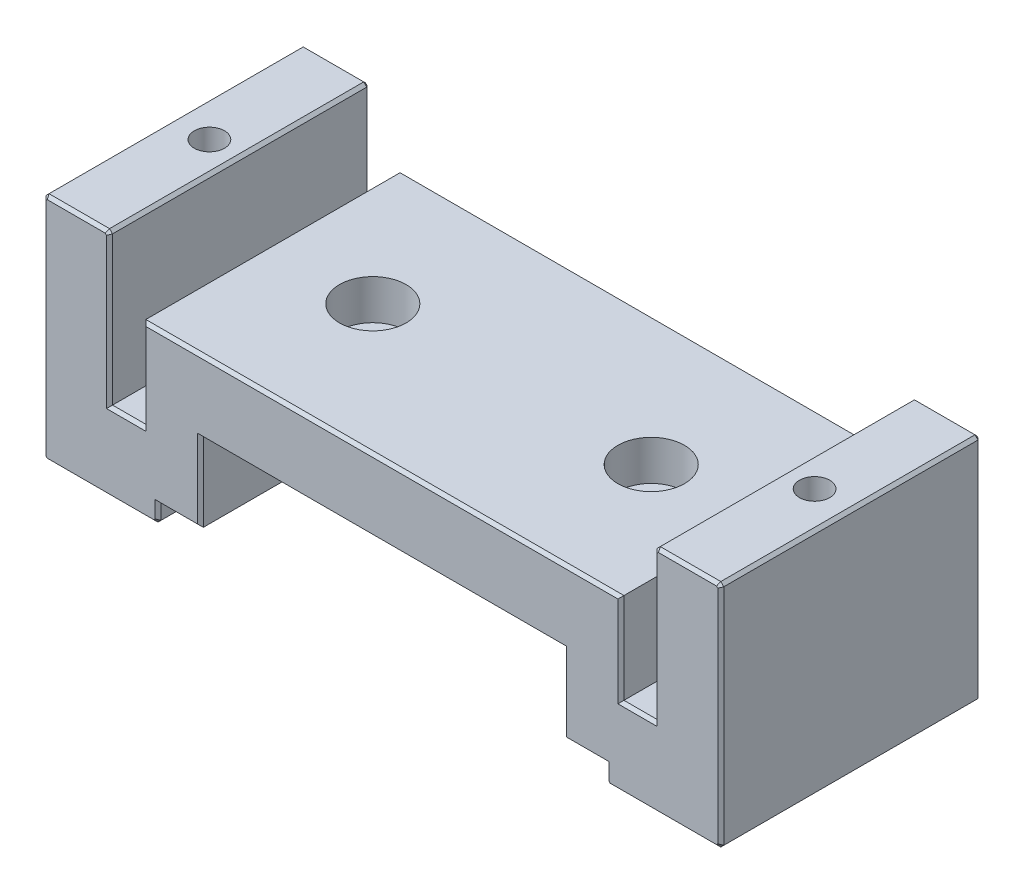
ISO-10303-21;
HEADER;
FILE_DESCRIPTION(('STEP AP214'),'2;1');
FILE_NAME('part.step','',(''),(''),'','','');
FILE_SCHEMA(('AUTOMOTIVE_DESIGN { 1 0 10303 214 1 1 1 1 }'));
ENDSEC;
DATA;
#1=APPLICATION_CONTEXT('core data for automotive mechanical design processes');
#2=APPLICATION_PROTOCOL_DEFINITION('international standard','automotive_design',2000,#1);
#3=PRODUCT_CONTEXT('',#1,'mechanical');
#4=PRODUCT('Part','Part','',(#3));
#5=PRODUCT_RELATED_PRODUCT_CATEGORY('part','',(#4));
#6=PRODUCT_DEFINITION_FORMATION('','',#4);
#7=PRODUCT_DEFINITION_CONTEXT('part definition',#1,'design');
#8=PRODUCT_DEFINITION('design','',#6,#7);
#9=PRODUCT_DEFINITION_SHAPE('','',#8);
#10=(LENGTH_UNIT() NAMED_UNIT(*) SI_UNIT(.MILLI.,.METRE.));
#11=(NAMED_UNIT(*) PLANE_ANGLE_UNIT() SI_UNIT($,.RADIAN.));
#12=(NAMED_UNIT(*) SI_UNIT($,.STERADIAN.) SOLID_ANGLE_UNIT());
#13=UNCERTAINTY_MEASURE_WITH_UNIT(LENGTH_MEASURE(1.E-05),#10,'distance_accuracy_value','');
#14=(GEOMETRIC_REPRESENTATION_CONTEXT(3) GLOBAL_UNCERTAINTY_ASSIGNED_CONTEXT((#13)) GLOBAL_UNIT_ASSIGNED_CONTEXT((#10,
#11,#12)) REPRESENTATION_CONTEXT('',''));
#15=CARTESIAN_POINT('',(0.,0.,0.));
#16=DIRECTION('',(0.,0.,1.));
#17=DIRECTION('',(1.,0.,0.));
#18=AXIS2_PLACEMENT_3D('',#15,#16,#17);
#19=CARTESIAN_POINT('',(-570.967966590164,2207.46948693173,21.5));
#20=DIRECTION('',(0.707106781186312,0.707106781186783,0.));
#21=DIRECTION('',(-0.707106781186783,0.707106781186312,0.));
#22=AXIS2_PLACEMENT_3D('',#19,#20,#21);
#23=PLANE('',#22);
#24=DIRECTION('',(0.,0.,-1.));
#25=VECTOR('',#24,1.);
#26=CARTESIAN_POINT('',(-570.967966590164,2207.46948693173,21.5));
#27=LINE('',#26,#25);
#28=CARTESIAN_POINT('',(-570.967966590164,2207.46948693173,21.0000000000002));
#29=VERTEX_POINT('',#28);
#30=CARTESIAN_POINT('',(-570.967966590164,2207.46948693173,-21.0000000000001));
#31=VERTEX_POINT('',#30);
#32=EDGE_CURVE('E454',#29,#31,#27,.T.);
#33=ORIENTED_EDGE('',*,*,#32,.T.);
#34=DIRECTION('',(0.707106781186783,-0.707106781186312,0.));
#35=VECTOR('',#34,1.);
#36=CARTESIAN_POINT('',(-570.967966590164,2207.46948693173,-21.0000000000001));
#37=LINE('',#36,#35);
#38=CARTESIAN_POINT('',(-570.467966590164,2206.96948693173,-21.0000000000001));
#39=VERTEX_POINT('',#38);
#40=EDGE_CURVE('E715',#31,#39,#37,.T.);
#41=ORIENTED_EDGE('',*,*,#40,.T.);
#42=DIRECTION('',(0.,0.,-1.));
#43=VECTOR('',#42,1.);
#44=CARTESIAN_POINT('',(-570.467966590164,2206.96948693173,21.5));
#45=LINE('',#44,#43);
#46=CARTESIAN_POINT('',(-570.467966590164,2206.96948693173,21.0000000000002));
#47=VERTEX_POINT('',#46);
#48=EDGE_CURVE('E535',#47,#39,#45,.T.);
#49=ORIENTED_EDGE('',*,*,#48,.F.);
#50=DIRECTION('',(-0.707106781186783,0.707106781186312,0.));
#51=VECTOR('',#50,1.);
#52=CARTESIAN_POINT('',(-570.967966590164,2207.46948693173,21.0000000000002));
#53=LINE('',#52,#51);
#54=EDGE_CURVE('E713',#47,#29,#53,.T.);
#55=ORIENTED_EDGE('',*,*,#54,.T.);
#56=EDGE_LOOP('',(#33,#41,#49,#55));
#57=FACE_BOUND('',#56,.T.);
#58=ADVANCED_FACE('F38',(#57),#23,.F.);
#59=CARTESIAN_POINT('',(-552.467966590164,2206.96948693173,21.5));
#60=DIRECTION('',(0.,1.,0.));
#61=DIRECTION('',(0.,0.,1.));
#62=AXIS2_PLACEMENT_3D('',#59,#60,#61);
#63=PLANE('',#62);
#64=CARTESIAN_POINT('',(-557.967966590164,2206.96948693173,-4.));
#65=DIRECTION('',(0.,-1.,0.));
#66=DIRECTION('',(0.,0.,-1.));
#67=AXIS2_PLACEMENT_3D('',#64,#65,#66);
#68=CIRCLE('',#67,1.24999999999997);
#69=CARTESIAN_POINT('',(-557.967966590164,2206.96948693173,-5.24999999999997));
#70=VERTEX_POINT('',#69);
#71=EDGE_CURVE('E418',#70,#70,#68,.T.);
#72=ORIENTED_EDGE('',*,*,#71,.F.);
#73=EDGE_LOOP('',(#72));
#74=FACE_BOUND('',#73,.T.);
#75=CARTESIAN_POINT('',(-557.967966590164,2206.96948693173,4.));
#76=DIRECTION('',(0.,-1.,0.));
#77=DIRECTION('',(0.,0.,-1.));
#78=AXIS2_PLACEMENT_3D('',#75,#76,#77);
#79=CIRCLE('',#78,1.24999999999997);
#80=CARTESIAN_POINT('',(-557.967966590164,2206.96948693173,2.75000000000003));
#81=VERTEX_POINT('',#80);
#82=EDGE_CURVE('E417',#81,#81,#79,.T.);
#83=ORIENTED_EDGE('',*,*,#82,.F.);
#84=EDGE_LOOP('',(#83));
#85=FACE_BOUND('',#84,.T.);
#86=ORIENTED_EDGE('',*,*,#48,.T.);
#87=DIRECTION('',(1.,0.,0.));
#88=VECTOR('',#87,1.);
#89=CARTESIAN_POINT('',(-552.467966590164,2206.96948693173,-21.0000000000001));
#90=LINE('',#89,#88);
#91=CARTESIAN_POINT('',(-552.467966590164,2206.96948693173,-21.0000000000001));
#92=VERTEX_POINT('',#91);
#93=EDGE_CURVE('E548',#39,#92,#90,.T.);
#94=ORIENTED_EDGE('',*,*,#93,.T.);
#95=DIRECTION('',(0.,0.,-1.));
#96=VECTOR('',#95,1.);
#97=CARTESIAN_POINT('',(-552.467966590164,2206.96948693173,21.5));
#98=LINE('',#97,#96);
#99=CARTESIAN_POINT('',(-552.467966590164,2206.96948693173,21.));
#100=VERTEX_POINT('',#99);
#101=EDGE_CURVE('E532',#100,#92,#98,.T.);
#102=ORIENTED_EDGE('',*,*,#101,.F.);
#103=DIRECTION('',(-1.,0.,0.));
#104=VECTOR('',#103,1.);
#105=CARTESIAN_POINT('',(-570.467966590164,2206.96948693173,21.));
#106=LINE('',#105,#104);
#107=EDGE_CURVE('E538',#100,#47,#106,.T.);
#108=ORIENTED_EDGE('',*,*,#107,.T.);
#109=EDGE_LOOP('',(#86,#94,#102,#108));
#110=FACE_BOUND('',#109,.T.);
#111=ADVANCED_FACE('F1020',(#74,#85,#110),#63,.F.);
#112=CARTESIAN_POINT('',(-552.467966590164,2206.96948693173,21.5));
#113=DIRECTION('',(-0.707106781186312,0.707106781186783,0.));
#114=DIRECTION('',(-0.707106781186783,-0.707106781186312,0.));
#115=AXIS2_PLACEMENT_3D('',#112,#113,#114);
#116=PLANE('',#115);
#117=ORIENTED_EDGE('',*,*,#101,.T.);
#118=DIRECTION('',(0.707106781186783,0.707106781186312,0.));
#119=VECTOR('',#118,1.);
#120=CARTESIAN_POINT('',(-552.467966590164,2206.96948693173,-21.0000000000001));
#121=LINE('',#120,#119);
#122=CARTESIAN_POINT('',(-551.967966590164,2207.46948693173,-21.0000000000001));
#123=VERTEX_POINT('',#122);
#124=EDGE_CURVE('E610',#92,#123,#121,.T.);
#125=ORIENTED_EDGE('',*,*,#124,.T.);
#126=DIRECTION('',(0.,0.,-1.));
#127=VECTOR('',#126,1.);
#128=CARTESIAN_POINT('',(-551.967966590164,2207.46948693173,21.5));
#129=LINE('',#128,#127);
#130=CARTESIAN_POINT('',(-551.967966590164,2207.46948693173,21.0000000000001));
#131=VERTEX_POINT('',#130);
#132=EDGE_CURVE('E529',#131,#123,#129,.T.);
#133=ORIENTED_EDGE('',*,*,#132,.F.);
#134=DIRECTION('',(-0.707106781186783,-0.707106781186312,0.));
#135=VECTOR('',#134,1.);
#136=CARTESIAN_POINT('',(-552.467966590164,2206.96948693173,21.0000000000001));
#137=LINE('',#136,#135);
#138=EDGE_CURVE('E608',#131,#100,#137,.T.);
#139=ORIENTED_EDGE('',*,*,#138,.T.);
#140=EDGE_LOOP('',(#117,#125,#133,#139));
#141=FACE_BOUND('',#140,.T.);
#142=ADVANCED_FACE('F1026',(#141),#116,.F.);
#143=CARTESIAN_POINT('',(-551.967966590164,2244.46948693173,21.5));
#144=DIRECTION('',(-1.,0.,0.));
#145=DIRECTION('',(0.,0.,1.));
#146=AXIS2_PLACEMENT_3D('',#143,#144,#145);
#147=PLANE('',#146);
#148=ORIENTED_EDGE('',*,*,#132,.T.);
#149=DIRECTION('',(0.,1.,0.));
#150=VECTOR('',#149,1.);
#151=CARTESIAN_POINT('',(-551.967966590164,2244.46948693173,-21.0000000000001));
#152=LINE('',#151,#150);
#153=CARTESIAN_POINT('',(-551.967966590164,2244.46948693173,-21.0000000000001));
#154=VERTEX_POINT('',#153);
#155=EDGE_CURVE('E614',#123,#154,#152,.T.);
#156=ORIENTED_EDGE('',*,*,#155,.T.);
#157=DIRECTION('',(0.,0.,-1.));
#158=VECTOR('',#157,1.);
#159=CARTESIAN_POINT('',(-551.967966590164,2244.46948693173,21.5));
#160=LINE('',#159,#158);
#161=CARTESIAN_POINT('',(-551.967966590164,2244.46948693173,21.));
#162=VERTEX_POINT('',#161);
#163=EDGE_CURVE('E526',#162,#154,#160,.T.);
#164=ORIENTED_EDGE('',*,*,#163,.F.);
#165=DIRECTION('',(0.,-1.,0.));
#166=VECTOR('',#165,1.);
#167=CARTESIAN_POINT('',(-551.967966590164,2207.46948693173,21.));
#168=LINE('',#167,#166);
#169=EDGE_CURVE('E612',#162,#131,#168,.T.);
#170=ORIENTED_EDGE('',*,*,#169,.T.);
#171=EDGE_LOOP('',(#148,#156,#164,#170));
#172=FACE_BOUND('',#171,.T.);
#173=ADVANCED_FACE('F1905',(#172),#147,.F.);
#174=CARTESIAN_POINT('',(-551.967966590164,2244.46948693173,21.5));
#175=DIRECTION('',(-0.707106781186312,-0.707106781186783,0.));
#176=DIRECTION('',(0.707106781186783,-0.707106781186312,0.));
#177=AXIS2_PLACEMENT_3D('',#174,#175,#176);
#178=PLANE('',#177);
#179=ORIENTED_EDGE('',*,*,#163,.T.);
#180=DIRECTION('',(-0.707106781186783,0.707106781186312,0.));
#181=VECTOR('',#180,1.);
#182=CARTESIAN_POINT('',(-551.967966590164,2244.46948693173,-21.0000000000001));
#183=LINE('',#182,#181);
#184=CARTESIAN_POINT('',(-552.467966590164,2244.96948693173,-21.0000000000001));
#185=VERTEX_POINT('',#184);
#186=EDGE_CURVE('E618',#154,#185,#183,.T.);
#187=ORIENTED_EDGE('',*,*,#186,.T.);
#188=DIRECTION('',(0.,0.,-1.));
#189=VECTOR('',#188,1.);
#190=CARTESIAN_POINT('',(-552.467966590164,2244.96948693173,21.5));
#191=LINE('',#190,#189);
#192=CARTESIAN_POINT('',(-552.467966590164,2244.96948693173,20.9999999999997));
#193=VERTEX_POINT('',#192);
#194=EDGE_CURVE('E523',#193,#185,#191,.T.);
#195=ORIENTED_EDGE('',*,*,#194,.F.);
#196=DIRECTION('',(0.707106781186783,-0.707106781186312,0.));
#197=VECTOR('',#196,1.);
#198=CARTESIAN_POINT('',(-551.967966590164,2244.46948693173,20.9999999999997));
#199=LINE('',#198,#197);
#200=EDGE_CURVE('E616',#193,#162,#199,.T.);
#201=ORIENTED_EDGE('',*,*,#200,.T.);
#202=EDGE_LOOP('',(#179,#187,#195,#201));
#203=FACE_BOUND('',#202,.T.);
#204=ADVANCED_FACE('F1896',(#203),#178,.F.);
#205=CARTESIAN_POINT('',(-562.467966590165,2244.96948693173,21.5));
#206=DIRECTION('',(0.,-1.,0.));
#207=DIRECTION('',(0.,0.,-1.));
#208=AXIS2_PLACEMENT_3D('',#205,#206,#207);
#209=PLANE('',#208);
#210=CARTESIAN_POINT('',(-557.967966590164,2244.96948693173,0.));
#211=DIRECTION('',(0.,1.,0.));
#212=DIRECTION('',(0.,0.,1.));
#213=AXIS2_PLACEMENT_3D('',#210,#211,#212);
#214=CIRCLE('',#213,2.49999999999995);
#215=CARTESIAN_POINT('',(-557.967966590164,2244.96948693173,2.49999999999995));
#216=VERTEX_POINT('',#215);
#217=EDGE_CURVE('E448',#216,#216,#214,.T.);
#218=ORIENTED_EDGE('',*,*,#217,.F.);
#219=EDGE_LOOP('',(#218));
#220=FACE_BOUND('',#219,.T.);
#221=ORIENTED_EDGE('',*,*,#194,.T.);
#222=DIRECTION('',(-1.,0.,0.));
#223=VECTOR('',#222,1.);
#224=CARTESIAN_POINT('',(-562.467966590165,2244.96948693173,-21.0000000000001));
#225=LINE('',#224,#223);
#226=CARTESIAN_POINT('',(-562.467966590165,2244.96948693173,-21.0000000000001));
#227=VERTEX_POINT('',#226);
#228=EDGE_CURVE('E622',#185,#227,#225,.T.);
#229=ORIENTED_EDGE('',*,*,#228,.T.);
#230=DIRECTION('',(0.,0.,-1.));
#231=VECTOR('',#230,1.);
#232=CARTESIAN_POINT('',(-562.467966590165,2244.96948693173,21.5));
#233=LINE('',#232,#231);
#234=CARTESIAN_POINT('',(-562.467966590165,2244.96948693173,21.));
#235=VERTEX_POINT('',#234);
#236=EDGE_CURVE('E520',#235,#227,#233,.T.);
#237=ORIENTED_EDGE('',*,*,#236,.F.);
#238=DIRECTION('',(1.,0.,0.));
#239=VECTOR('',#238,1.);
#240=CARTESIAN_POINT('',(-552.467966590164,2244.96948693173,21.));
#241=LINE('',#240,#239);
#242=EDGE_CURVE('E620',#235,#193,#241,.T.);
#243=ORIENTED_EDGE('',*,*,#242,.T.);
#244=EDGE_LOOP('',(#221,#229,#237,#243));
#245=FACE_BOUND('',#244,.T.);
#246=ADVANCED_FACE('F1887',(#220,#245),#209,.F.);
#247=CARTESIAN_POINT('',(-562.467966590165,2244.96948693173,21.5));
#248=DIRECTION('',(0.707106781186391,-0.707106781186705,0.));
#249=DIRECTION('',(0.707106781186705,0.707106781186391,0.));
#250=AXIS2_PLACEMENT_3D('',#247,#248,#249);
#251=PLANE('',#250);
#252=ORIENTED_EDGE('',*,*,#236,.T.);
#253=DIRECTION('',(-0.707106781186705,-0.707106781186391,0.));
#254=VECTOR('',#253,1.);
#255=CARTESIAN_POINT('',(-562.467966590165,2244.96948693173,-21.0000000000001));
#256=LINE('',#255,#254);
#257=CARTESIAN_POINT('',(-562.967966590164,2244.46948693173,-21.0000000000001));
#258=VERTEX_POINT('',#257);
#259=EDGE_CURVE('E626',#227,#258,#256,.T.);
#260=ORIENTED_EDGE('',*,*,#259,.T.);
#261=DIRECTION('',(0.,0.,-1.));
#262=VECTOR('',#261,1.);
#263=CARTESIAN_POINT('',(-562.967966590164,2244.46948693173,21.5));
#264=LINE('',#263,#262);
#265=CARTESIAN_POINT('',(-562.967966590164,2244.46948693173,21.));
#266=VERTEX_POINT('',#265);
#267=EDGE_CURVE('E517',#266,#258,#264,.T.);
#268=ORIENTED_EDGE('',*,*,#267,.F.);
#269=DIRECTION('',(0.707106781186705,0.707106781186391,0.));
#270=VECTOR('',#269,1.);
#271=CARTESIAN_POINT('',(-562.467966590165,2244.96948693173,21.));
#272=LINE('',#271,#270);
#273=EDGE_CURVE('E624',#266,#235,#272,.T.);
#274=ORIENTED_EDGE('',*,*,#273,.T.);
#275=EDGE_LOOP('',(#252,#260,#268,#274));
#276=FACE_BOUND('',#275,.T.);
#277=ADVANCED_FACE('F1878',(#276),#251,.F.);
#278=CARTESIAN_POINT('',(-562.967966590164,2219.96948693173,21.5));
#279=DIRECTION('',(1.,0.,0.));
#280=DIRECTION('',(0.,0.,-1.));
#281=AXIS2_PLACEMENT_3D('',#278,#279,#280);
#282=PLANE('',#281);
#283=ORIENTED_EDGE('',*,*,#267,.T.);
#284=DIRECTION('',(0.,-1.,0.));
#285=VECTOR('',#284,1.);
#286=CARTESIAN_POINT('',(-562.967966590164,2219.96948693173,-21.0000000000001));
#287=LINE('',#286,#285);
#288=CARTESIAN_POINT('',(-562.967966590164,2219.96948693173,-21.0000000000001));
#289=VERTEX_POINT('',#288);
#290=EDGE_CURVE('E630',#258,#289,#287,.T.);
#291=ORIENTED_EDGE('',*,*,#290,.T.);
#292=DIRECTION('',(0.,0.,-1.));
#293=VECTOR('',#292,1.);
#294=CARTESIAN_POINT('',(-562.967966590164,2219.96948693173,21.5));
#295=LINE('',#294,#293);
#296=CARTESIAN_POINT('',(-562.967966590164,2219.96948693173,21.));
#297=VERTEX_POINT('',#296);
#298=EDGE_CURVE('E514',#297,#289,#295,.T.);
#299=ORIENTED_EDGE('',*,*,#298,.F.);
#300=DIRECTION('',(0.,1.,0.));
#301=VECTOR('',#300,1.);
#302=CARTESIAN_POINT('',(-562.967966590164,2244.46948693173,21.));
#303=LINE('',#302,#301);
#304=EDGE_CURVE('E628',#297,#266,#303,.T.);
#305=ORIENTED_EDGE('',*,*,#304,.T.);
#306=EDGE_LOOP('',(#283,#291,#299,#305));
#307=FACE_BOUND('',#306,.T.);
#308=ADVANCED_FACE('F1869',(#307),#282,.F.);
#309=CARTESIAN_POINT('',(-568.467966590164,2219.96948693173,21.5));
#310=DIRECTION('',(0.,-1.,0.));
#311=DIRECTION('',(0.,0.,-1.));
#312=AXIS2_PLACEMENT_3D('',#309,#310,#311);
#313=PLANE('',#312);
#314=ORIENTED_EDGE('',*,*,#298,.T.);
#315=DIRECTION('',(-1.,0.,0.));
#316=VECTOR('',#315,1.);
#317=CARTESIAN_POINT('',(-568.467966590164,2219.96948693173,-21.0000000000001));
#318=LINE('',#317,#316);
#319=CARTESIAN_POINT('',(-568.467966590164,2219.96948693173,-21.0000000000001));
#320=VERTEX_POINT('',#319);
#321=EDGE_CURVE('E634',#289,#320,#318,.T.);
#322=ORIENTED_EDGE('',*,*,#321,.T.);
#323=DIRECTION('',(0.,0.,-1.));
#324=VECTOR('',#323,1.);
#325=CARTESIAN_POINT('',(-568.467966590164,2219.96948693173,21.5));
#326=LINE('',#325,#324);
#327=CARTESIAN_POINT('',(-568.467966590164,2219.96948693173,21.));
#328=VERTEX_POINT('',#327);
#329=EDGE_CURVE('E511',#328,#320,#326,.T.);
#330=ORIENTED_EDGE('',*,*,#329,.F.);
#331=DIRECTION('',(1.,0.,0.));
#332=VECTOR('',#331,1.);
#333=CARTESIAN_POINT('',(-562.967966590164,2219.96948693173,21.));
#334=LINE('',#333,#332);
#335=EDGE_CURVE('E632',#328,#297,#334,.T.);
#336=ORIENTED_EDGE('',*,*,#335,.T.);
#337=EDGE_LOOP('',(#314,#322,#330,#336));
#338=FACE_BOUND('',#337,.T.);
#339=ADVANCED_FACE('F1860',(#338),#313,.F.);
#340=CARTESIAN_POINT('',(-568.467966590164,2234.96948693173,21.5));
#341=DIRECTION('',(-1.,0.,0.));
#342=DIRECTION('',(0.,0.,1.));
#343=AXIS2_PLACEMENT_3D('',#340,#341,#342);
#344=PLANE('',#343);
#345=ORIENTED_EDGE('',*,*,#329,.T.);
#346=DIRECTION('',(0.,1.,0.));
#347=VECTOR('',#346,1.);
#348=CARTESIAN_POINT('',(-568.467966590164,2234.96948693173,-21.0000000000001));
#349=LINE('',#348,#347);
#350=CARTESIAN_POINT('',(-568.467966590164,2234.96948693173,-21.0000000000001));
#351=VERTEX_POINT('',#350);
#352=EDGE_CURVE('E638',#320,#351,#349,.T.);
#353=ORIENTED_EDGE('',*,*,#352,.T.);
#354=DIRECTION('',(0.,0.,-1.));
#355=VECTOR('',#354,1.);
#356=CARTESIAN_POINT('',(-568.467966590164,2234.96948693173,21.5));
#357=LINE('',#356,#355);
#358=CARTESIAN_POINT('',(-568.467966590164,2234.96948693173,21.));
#359=VERTEX_POINT('',#358);
#360=EDGE_CURVE('E508',#359,#351,#357,.T.);
#361=ORIENTED_EDGE('',*,*,#360,.F.);
#362=DIRECTION('',(0.,-1.,0.));
#363=VECTOR('',#362,1.);
#364=CARTESIAN_POINT('',(-568.467966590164,2219.96948693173,21.));
#365=LINE('',#364,#363);
#366=EDGE_CURVE('E636',#359,#328,#365,.T.);
#367=ORIENTED_EDGE('',*,*,#366,.T.);
#368=EDGE_LOOP('',(#345,#353,#361,#367));
#369=FACE_BOUND('',#368,.T.);
#370=ADVANCED_FACE('F1851',(#369),#344,.F.);
#371=CARTESIAN_POINT('',(-647.467966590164,2234.96948693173,21.5));
#372=DIRECTION('',(0.,-1.,0.));
#373=DIRECTION('',(0.,0.,-1.));
#374=AXIS2_PLACEMENT_3D('',#371,#372,#373);
#375=PLANE('',#374);
#376=CARTESIAN_POINT('',(-584.967966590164,2234.96948693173,0.));
#377=DIRECTION('',(0.,1.,0.));
#378=DIRECTION('',(0.,0.,1.));
#379=AXIS2_PLACEMENT_3D('',#376,#377,#378);
#380=CIRCLE('',#379,5.49999999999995);
#381=CARTESIAN_POINT('',(-584.967966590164,2234.96948693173,5.49999999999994));
#382=VERTEX_POINT('',#381);
#383=EDGE_CURVE('E851',#382,#382,#380,.T.);
#384=ORIENTED_EDGE('',*,*,#383,.F.);
#385=EDGE_LOOP('',(#384));
#386=FACE_BOUND('',#385,.T.);
#387=CARTESIAN_POINT('',(-630.967966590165,2234.96948693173,0.));
#388=DIRECTION('',(0.,1.,0.));
#389=DIRECTION('',(0.,0.,1.));
#390=AXIS2_PLACEMENT_3D('',#387,#388,#389);
#391=CIRCLE('',#390,5.49999999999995);
#392=CARTESIAN_POINT('',(-630.967966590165,2234.96948693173,5.49999999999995));
#393=VERTEX_POINT('',#392);
#394=EDGE_CURVE('E545',#393,#393,#391,.T.);
#395=ORIENTED_EDGE('',*,*,#394,.F.);
#396=EDGE_LOOP('',(#395));
#397=FACE_BOUND('',#396,.T.);
#398=ORIENTED_EDGE('',*,*,#360,.T.);
#399=DIRECTION('',(-1.,0.,0.));
#400=VECTOR('',#399,1.);
#401=CARTESIAN_POINT('',(-647.467966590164,2234.96948693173,-21.0000000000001));
#402=LINE('',#401,#400);
#403=CARTESIAN_POINT('',(-647.467966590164,2234.96948693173,-21.0000000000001));
#404=VERTEX_POINT('',#403);
#405=EDGE_CURVE('E642',#351,#404,#402,.T.);
#406=ORIENTED_EDGE('',*,*,#405,.T.);
#407=DIRECTION('',(0.,0.,-1.));
#408=VECTOR('',#407,1.);
#409=CARTESIAN_POINT('',(-647.467966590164,2234.96948693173,21.5));
#410=LINE('',#409,#408);
#411=CARTESIAN_POINT('',(-647.467966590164,2234.96948693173,21.));
#412=VERTEX_POINT('',#411);
#413=EDGE_CURVE('E505',#412,#404,#410,.T.);
#414=ORIENTED_EDGE('',*,*,#413,.F.);
#415=DIRECTION('',(1.,0.,0.));
#416=VECTOR('',#415,1.);
#417=CARTESIAN_POINT('',(-568.467966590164,2234.96948693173,21.));
#418=LINE('',#417,#416);
#419=EDGE_CURVE('E640',#412,#359,#418,.T.);
#420=ORIENTED_EDGE('',*,*,#419,.T.);
#421=EDGE_LOOP('',(#398,#406,#414,#420));
#422=FACE_BOUND('',#421,.T.);
#423=ADVANCED_FACE('F1842',(#386,#397,#422),#375,.F.);
#424=CARTESIAN_POINT('',(-647.467966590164,2219.96948693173,21.5));
#425=DIRECTION('',(1.,0.,0.));
#426=DIRECTION('',(0.,0.,-1.));
#427=AXIS2_PLACEMENT_3D('',#424,#425,#426);
#428=PLANE('',#427);
#429=ORIENTED_EDGE('',*,*,#413,.T.);
#430=DIRECTION('',(0.,-1.,0.));
#431=VECTOR('',#430,1.);
#432=CARTESIAN_POINT('',(-647.467966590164,2219.96948693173,-21.0000000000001));
#433=LINE('',#432,#431);
#434=CARTESIAN_POINT('',(-647.467966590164,2219.96948693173,-21.0000000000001));
#435=VERTEX_POINT('',#434);
#436=EDGE_CURVE('E646',#404,#435,#433,.T.);
#437=ORIENTED_EDGE('',*,*,#436,.T.);
#438=DIRECTION('',(0.,0.,-1.));
#439=VECTOR('',#438,1.);
#440=CARTESIAN_POINT('',(-647.467966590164,2219.96948693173,21.5));
#441=LINE('',#440,#439);
#442=CARTESIAN_POINT('',(-647.467966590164,2219.96948693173,21.));
#443=VERTEX_POINT('',#442);
#444=EDGE_CURVE('E502',#443,#435,#441,.T.);
#445=ORIENTED_EDGE('',*,*,#444,.F.);
#446=DIRECTION('',(0.,1.,0.));
#447=VECTOR('',#446,1.);
#448=CARTESIAN_POINT('',(-647.467966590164,2234.96948693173,21.));
#449=LINE('',#448,#447);
#450=EDGE_CURVE('E644',#443,#412,#449,.T.);
#451=ORIENTED_EDGE('',*,*,#450,.T.);
#452=EDGE_LOOP('',(#429,#437,#445,#451));
#453=FACE_BOUND('',#452,.T.);
#454=ADVANCED_FACE('F1834',(#453),#428,.F.);
#455=CARTESIAN_POINT('',(-652.967966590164,2219.96948693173,21.5));
#456=DIRECTION('',(0.,-1.,0.));
#457=DIRECTION('',(0.,0.,-1.));
#458=AXIS2_PLACEMENT_3D('',#455,#456,#457);
#459=PLANE('',#458);
#460=ORIENTED_EDGE('',*,*,#444,.T.);
#461=DIRECTION('',(-1.,0.,0.));
#462=VECTOR('',#461,1.);
#463=CARTESIAN_POINT('',(-652.967966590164,2219.96948693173,-21.0000000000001));
#464=LINE('',#463,#462);
#465=CARTESIAN_POINT('',(-652.967966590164,2219.96948693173,-21.0000000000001));
#466=VERTEX_POINT('',#465);
#467=EDGE_CURVE('E650',#435,#466,#464,.T.);
#468=ORIENTED_EDGE('',*,*,#467,.T.);
#469=DIRECTION('',(0.,0.,-1.));
#470=VECTOR('',#469,1.);
#471=CARTESIAN_POINT('',(-652.967966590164,2219.96948693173,21.5));
#472=LINE('',#471,#470);
#473=CARTESIAN_POINT('',(-652.967966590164,2219.96948693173,21.));
#474=VERTEX_POINT('',#473);
#475=EDGE_CURVE('E499',#474,#466,#472,.T.);
#476=ORIENTED_EDGE('',*,*,#475,.F.);
#477=DIRECTION('',(1.,0.,0.));
#478=VECTOR('',#477,1.);
#479=CARTESIAN_POINT('',(-647.467966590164,2219.96948693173,21.));
#480=LINE('',#479,#478);
#481=EDGE_CURVE('E648',#474,#443,#480,.T.);
#482=ORIENTED_EDGE('',*,*,#481,.T.);
#483=EDGE_LOOP('',(#460,#468,#476,#482));
#484=FACE_BOUND('',#483,.T.);
#485=ADVANCED_FACE('F949',(#484),#459,.F.);
#486=CARTESIAN_POINT('',(-652.967966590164,2244.46948693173,21.5));
#487=DIRECTION('',(-1.,0.,0.));
#488=DIRECTION('',(0.,0.,1.));
#489=AXIS2_PLACEMENT_3D('',#486,#487,#488);
#490=PLANE('',#489);
#491=ORIENTED_EDGE('',*,*,#475,.T.);
#492=DIRECTION('',(0.,1.,0.));
#493=VECTOR('',#492,1.);
#494=CARTESIAN_POINT('',(-652.967966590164,2244.46948693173,-21.0000000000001));
#495=LINE('',#494,#493);
#496=CARTESIAN_POINT('',(-652.967966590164,2244.46948693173,-21.0000000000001));
#497=VERTEX_POINT('',#496);
#498=EDGE_CURVE('E654',#466,#497,#495,.T.);
#499=ORIENTED_EDGE('',*,*,#498,.T.);
#500=DIRECTION('',(0.,0.,-1.));
#501=VECTOR('',#500,1.);
#502=CARTESIAN_POINT('',(-652.967966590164,2244.46948693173,21.5));
#503=LINE('',#502,#501);
#504=CARTESIAN_POINT('',(-652.967966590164,2244.46948693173,21.));
#505=VERTEX_POINT('',#504);
#506=EDGE_CURVE('E496',#505,#497,#503,.T.);
#507=ORIENTED_EDGE('',*,*,#506,.F.);
#508=DIRECTION('',(0.,-1.,0.));
#509=VECTOR('',#508,1.);
#510=CARTESIAN_POINT('',(-652.967966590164,2219.96948693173,21.));
#511=LINE('',#510,#509);
#512=EDGE_CURVE('E652',#505,#474,#511,.T.);
#513=ORIENTED_EDGE('',*,*,#512,.T.);
#514=EDGE_LOOP('',(#491,#499,#507,#513));
#515=FACE_BOUND('',#514,.T.);
#516=ADVANCED_FACE('F946',(#515),#490,.F.);
#517=CARTESIAN_POINT('',(-652.967966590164,2244.46948693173,21.5));
#518=DIRECTION('',(-0.707106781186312,-0.707106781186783,0.));
#519=DIRECTION('',(0.707106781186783,-0.707106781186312,0.));
#520=AXIS2_PLACEMENT_3D('',#517,#518,#519);
#521=PLANE('',#520);
#522=ORIENTED_EDGE('',*,*,#506,.T.);
#523=DIRECTION('',(-0.707106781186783,0.707106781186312,0.));
#524=VECTOR('',#523,1.);
#525=CARTESIAN_POINT('',(-652.967966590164,2244.46948693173,-21.0000000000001));
#526=LINE('',#525,#524);
#527=CARTESIAN_POINT('',(-653.467966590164,2244.96948693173,-21.0000000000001));
#528=VERTEX_POINT('',#527);
#529=EDGE_CURVE('E658',#497,#528,#526,.T.);
#530=ORIENTED_EDGE('',*,*,#529,.T.);
#531=DIRECTION('',(0.,0.,-1.));
#532=VECTOR('',#531,1.);
#533=CARTESIAN_POINT('',(-653.467966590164,2244.96948693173,21.5));
#534=LINE('',#533,#532);
#535=CARTESIAN_POINT('',(-653.467966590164,2244.96948693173,20.9999999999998));
#536=VERTEX_POINT('',#535);
#537=EDGE_CURVE('E493',#536,#528,#534,.T.);
#538=ORIENTED_EDGE('',*,*,#537,.F.);
#539=DIRECTION('',(0.707106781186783,-0.707106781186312,0.));
#540=VECTOR('',#539,1.);
#541=CARTESIAN_POINT('',(-652.967966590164,2244.46948693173,20.9999999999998));
#542=LINE('',#541,#540);
#543=EDGE_CURVE('E656',#536,#505,#542,.T.);
#544=ORIENTED_EDGE('',*,*,#543,.T.);
#545=EDGE_LOOP('',(#522,#530,#538,#544));
#546=FACE_BOUND('',#545,.T.);
#547=ADVANCED_FACE('F973',(#546),#521,.F.);
#548=CARTESIAN_POINT('',(-663.467966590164,2244.96948693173,21.5));
#549=DIRECTION('',(0.,-1.,0.));
#550=DIRECTION('',(0.,0.,-1.));
#551=AXIS2_PLACEMENT_3D('',#548,#549,#550);
#552=PLANE('',#551);
#553=CARTESIAN_POINT('',(-657.967966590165,2244.96948693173,0.));
#554=DIRECTION('',(0.,1.,0.));
#555=DIRECTION('',(0.,0.,1.));
#556=AXIS2_PLACEMENT_3D('',#553,#554,#555);
#557=CIRCLE('',#556,2.49999999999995);
#558=CARTESIAN_POINT('',(-657.967966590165,2244.96948693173,2.49999999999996));
#559=VERTEX_POINT('',#558);
#560=EDGE_CURVE('E442',#559,#559,#557,.T.);
#561=ORIENTED_EDGE('',*,*,#560,.F.);
#562=EDGE_LOOP('',(#561));
#563=FACE_BOUND('',#562,.T.);
#564=ORIENTED_EDGE('',*,*,#537,.T.);
#565=DIRECTION('',(-1.,0.,0.));
#566=VECTOR('',#565,1.);
#567=CARTESIAN_POINT('',(-663.467966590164,2244.96948693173,-21.0000000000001));
#568=LINE('',#567,#566);
#569=CARTESIAN_POINT('',(-663.467966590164,2244.96948693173,-21.0000000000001));
#570=VERTEX_POINT('',#569);
#571=EDGE_CURVE('E662',#528,#570,#568,.T.);
#572=ORIENTED_EDGE('',*,*,#571,.T.);
#573=DIRECTION('',(0.,0.,-1.));
#574=VECTOR('',#573,1.);
#575=CARTESIAN_POINT('',(-663.467966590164,2244.96948693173,21.5));
#576=LINE('',#575,#574);
#577=CARTESIAN_POINT('',(-663.467966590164,2244.96948693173,21.));
#578=VERTEX_POINT('',#577);
#579=EDGE_CURVE('E490',#578,#570,#576,.T.);
#580=ORIENTED_EDGE('',*,*,#579,.F.);
#581=DIRECTION('',(1.,0.,0.));
#582=VECTOR('',#581,1.);
#583=CARTESIAN_POINT('',(-653.467966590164,2244.96948693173,21.));
#584=LINE('',#583,#582);
#585=EDGE_CURVE('E660',#578,#536,#584,.T.);
#586=ORIENTED_EDGE('',*,*,#585,.T.);
#587=EDGE_LOOP('',(#564,#572,#580,#586));
#588=FACE_BOUND('',#587,.T.);
#589=ADVANCED_FACE('F986',(#563,#588),#552,.F.);
#590=CARTESIAN_POINT('',(-663.467966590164,2244.96948693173,21.5));
#591=DIRECTION('',(0.707106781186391,-0.707106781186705,0.));
#592=DIRECTION('',(0.707106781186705,0.707106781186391,0.));
#593=AXIS2_PLACEMENT_3D('',#590,#591,#592);
#594=PLANE('',#593);
#595=ORIENTED_EDGE('',*,*,#579,.T.);
#596=DIRECTION('',(-0.707106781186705,-0.707106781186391,0.));
#597=VECTOR('',#596,1.);
#598=CARTESIAN_POINT('',(-663.467966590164,2244.96948693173,-21.0000000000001));
#599=LINE('',#598,#597);
#600=CARTESIAN_POINT('',(-663.967966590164,2244.46948693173,-21.0000000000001));
#601=VERTEX_POINT('',#600);
#602=EDGE_CURVE('E666',#570,#601,#599,.T.);
#603=ORIENTED_EDGE('',*,*,#602,.T.);
#604=DIRECTION('',(0.,0.,-1.));
#605=VECTOR('',#604,1.);
#606=CARTESIAN_POINT('',(-663.967966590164,2244.46948693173,21.5));
#607=LINE('',#606,#605);
#608=CARTESIAN_POINT('',(-663.967966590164,2244.46948693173,21.));
#609=VERTEX_POINT('',#608);
#610=EDGE_CURVE('E487',#609,#601,#607,.T.);
#611=ORIENTED_EDGE('',*,*,#610,.F.);
#612=DIRECTION('',(0.707106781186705,0.707106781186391,0.));
#613=VECTOR('',#612,1.);
#614=CARTESIAN_POINT('',(-663.467966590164,2244.96948693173,21.));
#615=LINE('',#614,#613);
#616=EDGE_CURVE('E664',#609,#578,#615,.T.);
#617=ORIENTED_EDGE('',*,*,#616,.T.);
#618=EDGE_LOOP('',(#595,#603,#611,#617));
#619=FACE_BOUND('',#618,.T.);
#620=ADVANCED_FACE('F989',(#619),#594,.F.);
#621=CARTESIAN_POINT('',(-663.967966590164,2207.46948693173,21.5));
#622=DIRECTION('',(1.,0.,0.));
#623=DIRECTION('',(0.,0.,-1.));
#624=AXIS2_PLACEMENT_3D('',#621,#622,#623);
#625=PLANE('',#624);
#626=ORIENTED_EDGE('',*,*,#610,.T.);
#627=DIRECTION('',(0.,-1.,0.));
#628=VECTOR('',#627,1.);
#629=CARTESIAN_POINT('',(-663.967966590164,2207.46948693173,-21.0000000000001));
#630=LINE('',#629,#628);
#631=CARTESIAN_POINT('',(-663.967966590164,2207.46948693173,-21.0000000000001));
#632=VERTEX_POINT('',#631);
#633=EDGE_CURVE('E670',#601,#632,#630,.T.);
#634=ORIENTED_EDGE('',*,*,#633,.T.);
#635=DIRECTION('',(0.,0.,-1.));
#636=VECTOR('',#635,1.);
#637=CARTESIAN_POINT('',(-663.967966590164,2207.46948693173,21.5));
#638=LINE('',#637,#636);
#639=CARTESIAN_POINT('',(-663.967966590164,2207.46948693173,21.));
#640=VERTEX_POINT('',#639);
#641=EDGE_CURVE('E484',#640,#632,#638,.T.);
#642=ORIENTED_EDGE('',*,*,#641,.F.);
#643=DIRECTION('',(0.,1.,0.));
#644=VECTOR('',#643,1.);
#645=CARTESIAN_POINT('',(-663.967966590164,2244.46948693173,21.));
#646=LINE('',#645,#644);
#647=EDGE_CURVE('E668',#640,#609,#646,.T.);
#648=ORIENTED_EDGE('',*,*,#647,.T.);
#649=EDGE_LOOP('',(#626,#634,#642,#648));
#650=FACE_BOUND('',#649,.T.);
#651=ADVANCED_FACE('F1788',(#650),#625,.F.);
#652=CARTESIAN_POINT('',(-663.467966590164,2206.96948693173,21.5));
#653=DIRECTION('',(0.707106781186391,0.707106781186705,0.));
#654=DIRECTION('',(-0.707106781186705,0.707106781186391,0.));
#655=AXIS2_PLACEMENT_3D('',#652,#653,#654);
#656=PLANE('',#655);
#657=ORIENTED_EDGE('',*,*,#641,.T.);
#658=DIRECTION('',(0.707106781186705,-0.707106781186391,0.));
#659=VECTOR('',#658,1.);
#660=CARTESIAN_POINT('',(-663.467966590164,2206.96948693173,-21.0000000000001));
#661=LINE('',#660,#659);
#662=CARTESIAN_POINT('',(-663.467966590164,2206.96948693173,-21.0000000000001));
#663=VERTEX_POINT('',#662);
#664=EDGE_CURVE('E674',#632,#663,#661,.T.);
#665=ORIENTED_EDGE('',*,*,#664,.T.);
#666=DIRECTION('',(0.,0.,-1.));
#667=VECTOR('',#666,1.);
#668=CARTESIAN_POINT('',(-663.467966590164,2206.96948693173,21.5));
#669=LINE('',#668,#667);
#670=CARTESIAN_POINT('',(-663.467966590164,2206.96948693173,20.9999999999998));
#671=VERTEX_POINT('',#670);
#672=EDGE_CURVE('E481',#671,#663,#669,.T.);
#673=ORIENTED_EDGE('',*,*,#672,.F.);
#674=DIRECTION('',(-0.707106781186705,0.707106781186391,0.));
#675=VECTOR('',#674,1.);
#676=CARTESIAN_POINT('',(-663.967966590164,2207.46948693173,20.9999999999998));
#677=LINE('',#676,#675);
#678=EDGE_CURVE('E672',#671,#640,#677,.T.);
#679=ORIENTED_EDGE('',*,*,#678,.T.);
#680=EDGE_LOOP('',(#657,#665,#673,#679));
#681=FACE_BOUND('',#680,.T.);
#682=ADVANCED_FACE('F1779',(#681),#656,.F.);
#683=CARTESIAN_POINT('',(-645.467966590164,2206.96948693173,21.5));
#684=DIRECTION('',(0.,1.,0.));
#685=DIRECTION('',(0.,0.,1.));
#686=AXIS2_PLACEMENT_3D('',#683,#684,#685);
#687=PLANE('',#686);
#688=CARTESIAN_POINT('',(-657.967966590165,2206.96948693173,-4.));
#689=DIRECTION('',(0.,-1.,0.));
#690=DIRECTION('',(0.,0.,-1.));
#691=AXIS2_PLACEMENT_3D('',#688,#689,#690);
#692=CIRCLE('',#691,1.24999999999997);
#693=CARTESIAN_POINT('',(-657.967966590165,2206.96948693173,-5.24999999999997));
#694=VERTEX_POINT('',#693);
#695=EDGE_CURVE('E430',#694,#694,#692,.T.);
#696=ORIENTED_EDGE('',*,*,#695,.F.);
#697=EDGE_LOOP('',(#696));
#698=FACE_BOUND('',#697,.T.);
#699=CARTESIAN_POINT('',(-657.967966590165,2206.96948693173,4.));
#700=DIRECTION('',(0.,-1.,0.));
#701=DIRECTION('',(0.,0.,-1.));
#702=AXIS2_PLACEMENT_3D('',#699,#700,#701);
#703=CIRCLE('',#702,1.24999999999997);
#704=CARTESIAN_POINT('',(-657.967966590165,2206.96948693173,2.75000000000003));
#705=VERTEX_POINT('',#704);
#706=EDGE_CURVE('E436',#705,#705,#703,.T.);
#707=ORIENTED_EDGE('',*,*,#706,.F.);
#708=EDGE_LOOP('',(#707));
#709=FACE_BOUND('',#708,.T.);
#710=ORIENTED_EDGE('',*,*,#672,.T.);
#711=DIRECTION('',(1.,0.,0.));
#712=VECTOR('',#711,1.);
#713=CARTESIAN_POINT('',(-645.467966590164,2206.96948693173,-21.0000000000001));
#714=LINE('',#713,#712);
#715=CARTESIAN_POINT('',(-645.467966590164,2206.96948693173,-21.0000000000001));
#716=VERTEX_POINT('',#715);
#717=EDGE_CURVE('E678',#663,#716,#714,.T.);
#718=ORIENTED_EDGE('',*,*,#717,.T.);
#719=DIRECTION('',(0.,0.,-1.));
#720=VECTOR('',#719,1.);
#721=CARTESIAN_POINT('',(-645.467966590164,2206.96948693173,21.5));
#722=LINE('',#721,#720);
#723=CARTESIAN_POINT('',(-645.467966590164,2206.96948693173,21.));
#724=VERTEX_POINT('',#723);
#725=EDGE_CURVE('E478',#724,#716,#722,.T.);
#726=ORIENTED_EDGE('',*,*,#725,.F.);
#727=DIRECTION('',(-1.,0.,0.));
#728=VECTOR('',#727,1.);
#729=CARTESIAN_POINT('',(-663.467966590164,2206.96948693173,21.));
#730=LINE('',#729,#728);
#731=EDGE_CURVE('E676',#724,#671,#730,.T.);
#732=ORIENTED_EDGE('',*,*,#731,.T.);
#733=EDGE_LOOP('',(#710,#718,#726,#732));
#734=FACE_BOUND('',#733,.T.);
#735=ADVANCED_FACE('F1770',(#698,#709,#734),#687,.F.);
#736=CARTESIAN_POINT('',(-645.467966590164,2206.96948693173,21.5));
#737=DIRECTION('',(-0.707106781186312,0.707106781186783,0.));
#738=DIRECTION('',(-0.707106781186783,-0.707106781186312,0.));
#739=AXIS2_PLACEMENT_3D('',#736,#737,#738);
#740=PLANE('',#739);
#741=ORIENTED_EDGE('',*,*,#725,.T.);
#742=DIRECTION('',(0.707106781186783,0.707106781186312,0.));
#743=VECTOR('',#742,1.);
#744=CARTESIAN_POINT('',(-645.467966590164,2206.96948693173,-21.0000000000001));
#745=LINE('',#744,#743);
#746=CARTESIAN_POINT('',(-644.967966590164,2207.46948693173,-21.0000000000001));
#747=VERTEX_POINT('',#746);
#748=EDGE_CURVE('E682',#716,#747,#745,.T.);
#749=ORIENTED_EDGE('',*,*,#748,.T.);
#750=DIRECTION('',(0.,0.,-1.));
#751=VECTOR('',#750,1.);
#752=CARTESIAN_POINT('',(-644.967966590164,2207.46948693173,21.5));
#753=LINE('',#752,#751);
#754=CARTESIAN_POINT('',(-644.967966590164,2207.46948693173,21.0000000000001));
#755=VERTEX_POINT('',#754);
#756=EDGE_CURVE('E475',#755,#747,#753,.T.);
#757=ORIENTED_EDGE('',*,*,#756,.F.);
#758=DIRECTION('',(-0.707106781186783,-0.707106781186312,0.));
#759=VECTOR('',#758,1.);
#760=CARTESIAN_POINT('',(-645.467966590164,2206.96948693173,21.0000000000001));
#761=LINE('',#760,#759);
#762=EDGE_CURVE('E680',#755,#724,#761,.T.);
#763=ORIENTED_EDGE('',*,*,#762,.T.);
#764=EDGE_LOOP('',(#741,#749,#757,#763));
#765=FACE_BOUND('',#764,.T.);
#766=ADVANCED_FACE('F1761',(#765),#740,.F.);
#767=CARTESIAN_POINT('',(-644.967966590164,2209.96948693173,21.5));
#768=DIRECTION('',(-1.,0.,0.));
#769=DIRECTION('',(0.,0.,1.));
#770=AXIS2_PLACEMENT_3D('',#767,#768,#769);
#771=PLANE('',#770);
#772=ORIENTED_EDGE('',*,*,#756,.T.);
#773=DIRECTION('',(0.,1.,0.));
#774=VECTOR('',#773,1.);
#775=CARTESIAN_POINT('',(-644.967966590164,2209.96948693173,-21.0000000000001));
#776=LINE('',#775,#774);
#777=CARTESIAN_POINT('',(-644.967966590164,2209.96948693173,-21.0000000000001));
#778=VERTEX_POINT('',#777);
#779=EDGE_CURVE('E686',#747,#778,#776,.T.);
#780=ORIENTED_EDGE('',*,*,#779,.T.);
#781=DIRECTION('',(0.,0.,-1.));
#782=VECTOR('',#781,1.);
#783=CARTESIAN_POINT('',(-644.967966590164,2209.96948693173,21.5));
#784=LINE('',#783,#782);
#785=CARTESIAN_POINT('',(-644.967966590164,2209.96948693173,21.));
#786=VERTEX_POINT('',#785);
#787=EDGE_CURVE('E472',#786,#778,#784,.T.);
#788=ORIENTED_EDGE('',*,*,#787,.F.);
#789=DIRECTION('',(0.,-1.,0.));
#790=VECTOR('',#789,1.);
#791=CARTESIAN_POINT('',(-644.967966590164,2207.46948693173,21.));
#792=LINE('',#791,#790);
#793=EDGE_CURVE('E684',#786,#755,#792,.T.);
#794=ORIENTED_EDGE('',*,*,#793,.T.);
#795=EDGE_LOOP('',(#772,#780,#788,#794));
#796=FACE_BOUND('',#795,.T.);
#797=ADVANCED_FACE('F1752',(#796),#771,.F.);
#798=CARTESIAN_POINT('',(-637.967966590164,2209.96948693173,21.5));
#799=DIRECTION('',(0.,1.,0.));
#800=DIRECTION('',(0.,0.,1.));
#801=AXIS2_PLACEMENT_3D('',#798,#799,#800);
#802=PLANE('',#801);
#803=ORIENTED_EDGE('',*,*,#787,.T.);
#804=DIRECTION('',(1.,0.,0.));
#805=VECTOR('',#804,1.);
#806=CARTESIAN_POINT('',(-637.967966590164,2209.96948693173,-21.0000000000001));
#807=LINE('',#806,#805);
#808=CARTESIAN_POINT('',(-637.967966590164,2209.96948693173,-21.0000000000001));
#809=VERTEX_POINT('',#808);
#810=EDGE_CURVE('E690',#778,#809,#807,.T.);
#811=ORIENTED_EDGE('',*,*,#810,.T.);
#812=DIRECTION('',(0.,0.,-1.));
#813=VECTOR('',#812,1.);
#814=CARTESIAN_POINT('',(-637.967966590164,2209.96948693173,21.5));
#815=LINE('',#814,#813);
#816=CARTESIAN_POINT('',(-637.967966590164,2209.96948693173,21.));
#817=VERTEX_POINT('',#816);
#818=EDGE_CURVE('E469',#817,#809,#815,.T.);
#819=ORIENTED_EDGE('',*,*,#818,.F.);
#820=DIRECTION('',(-1.,0.,0.));
#821=VECTOR('',#820,1.);
#822=CARTESIAN_POINT('',(-644.967966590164,2209.96948693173,21.));
#823=LINE('',#822,#821);
#824=EDGE_CURVE('E688',#817,#786,#823,.T.);
#825=ORIENTED_EDGE('',*,*,#824,.T.);
#826=EDGE_LOOP('',(#803,#811,#819,#825));
#827=FACE_BOUND('',#826,.T.);
#828=ADVANCED_FACE('F1743',(#827),#802,.F.);
#829=CARTESIAN_POINT('',(-637.967966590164,2222.96948693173,21.5));
#830=DIRECTION('',(-1.,0.,0.));
#831=DIRECTION('',(0.,0.,1.));
#832=AXIS2_PLACEMENT_3D('',#829,#830,#831);
#833=PLANE('',#832);
#834=ORIENTED_EDGE('',*,*,#818,.T.);
#835=DIRECTION('',(0.,1.,0.));
#836=VECTOR('',#835,1.);
#837=CARTESIAN_POINT('',(-637.967966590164,2222.96948693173,-21.0000000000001));
#838=LINE('',#837,#836);
#839=CARTESIAN_POINT('',(-637.967966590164,2222.96948693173,-21.0000000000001));
#840=VERTEX_POINT('',#839);
#841=EDGE_CURVE('E694',#809,#840,#838,.T.);
#842=ORIENTED_EDGE('',*,*,#841,.T.);
#843=DIRECTION('',(0.,0.,-1.));
#844=VECTOR('',#843,1.);
#845=CARTESIAN_POINT('',(-637.967966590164,2222.96948693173,21.5));
#846=LINE('',#845,#844);
#847=CARTESIAN_POINT('',(-637.967966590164,2222.96948693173,21.));
#848=VERTEX_POINT('',#847);
#849=EDGE_CURVE('E466',#848,#840,#846,.T.);
#850=ORIENTED_EDGE('',*,*,#849,.F.);
#851=DIRECTION('',(0.,-1.,0.));
#852=VECTOR('',#851,1.);
#853=CARTESIAN_POINT('',(-637.967966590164,2209.96948693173,21.));
#854=LINE('',#853,#852);
#855=EDGE_CURVE('E692',#848,#817,#854,.T.);
#856=ORIENTED_EDGE('',*,*,#855,.T.);
#857=EDGE_LOOP('',(#834,#842,#850,#856));
#858=FACE_BOUND('',#857,.T.);
#859=ADVANCED_FACE('F1734',(#858),#833,.F.);
#860=CARTESIAN_POINT('',(-577.967966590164,2222.96948693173,21.5));
#861=DIRECTION('',(0.,1.,0.));
#862=DIRECTION('',(0.,0.,1.));
#863=AXIS2_PLACEMENT_3D('',#860,#861,#862);
#864=PLANE('',#863);
#865=CARTESIAN_POINT('',(-584.967966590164,2222.96948693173,0.));
#866=DIRECTION('',(0.,1.,0.));
#867=DIRECTION('',(0.,0.,1.));
#868=AXIS2_PLACEMENT_3D('',#865,#866,#867);
#869=CIRCLE('',#868,3.29999999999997);
#870=CARTESIAN_POINT('',(-584.967966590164,2222.96948693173,3.29999999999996));
#871=VERTEX_POINT('',#870);
#872=EDGE_CURVE('E542',#871,#871,#869,.T.);
#873=ORIENTED_EDGE('',*,*,#872,.T.);
#874=EDGE_LOOP('',(#873));
#875=FACE_BOUND('',#874,.T.);
#876=CARTESIAN_POINT('',(-630.967966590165,2222.96948693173,0.));
#877=DIRECTION('',(0.,1.,0.));
#878=DIRECTION('',(0.,0.,1.));
#879=AXIS2_PLACEMENT_3D('',#876,#877,#878);
#880=CIRCLE('',#879,3.29999999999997);
#881=CARTESIAN_POINT('',(-630.967966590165,2222.96948693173,3.29999999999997));
#882=VERTEX_POINT('',#881);
#883=EDGE_CURVE('E424',#882,#882,#880,.T.);
#884=ORIENTED_EDGE('',*,*,#883,.T.);
#885=EDGE_LOOP('',(#884));
#886=FACE_BOUND('',#885,.T.);
#887=ORIENTED_EDGE('',*,*,#849,.T.);
#888=DIRECTION('',(1.,0.,0.));
#889=VECTOR('',#888,1.);
#890=CARTESIAN_POINT('',(-577.967966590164,2222.96948693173,-21.0000000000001));
#891=LINE('',#890,#889);
#892=CARTESIAN_POINT('',(-577.967966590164,2222.96948693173,-21.0000000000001));
#893=VERTEX_POINT('',#892);
#894=EDGE_CURVE('E698',#840,#893,#891,.T.);
#895=ORIENTED_EDGE('',*,*,#894,.T.);
#896=DIRECTION('',(0.,0.,-1.));
#897=VECTOR('',#896,1.);
#898=CARTESIAN_POINT('',(-577.967966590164,2222.96948693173,21.5));
#899=LINE('',#898,#897);
#900=CARTESIAN_POINT('',(-577.967966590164,2222.96948693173,21.));
#901=VERTEX_POINT('',#900);
#902=EDGE_CURVE('E463',#901,#893,#899,.T.);
#903=ORIENTED_EDGE('',*,*,#902,.F.);
#904=DIRECTION('',(-1.,0.,0.));
#905=VECTOR('',#904,1.);
#906=CARTESIAN_POINT('',(-637.967966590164,2222.96948693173,21.));
#907=LINE('',#906,#905);
#908=EDGE_CURVE('E696',#901,#848,#907,.T.);
#909=ORIENTED_EDGE('',*,*,#908,.T.);
#910=EDGE_LOOP('',(#887,#895,#903,#909));
#911=FACE_BOUND('',#910,.T.);
#912=ADVANCED_FACE('F1725',(#875,#886,#911),#864,.F.);
#913=CARTESIAN_POINT('',(-577.967966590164,2209.96948693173,21.5));
#914=DIRECTION('',(1.,0.,0.));
#915=DIRECTION('',(0.,0.,-1.));
#916=AXIS2_PLACEMENT_3D('',#913,#914,#915);
#917=PLANE('',#916);
#918=ORIENTED_EDGE('',*,*,#902,.T.);
#919=DIRECTION('',(0.,-1.,0.));
#920=VECTOR('',#919,1.);
#921=CARTESIAN_POINT('',(-577.967966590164,2209.96948693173,-21.0000000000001));
#922=LINE('',#921,#920);
#923=CARTESIAN_POINT('',(-577.967966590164,2209.96948693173,-21.0000000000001));
#924=VERTEX_POINT('',#923);
#925=EDGE_CURVE('E702',#893,#924,#922,.T.);
#926=ORIENTED_EDGE('',*,*,#925,.T.);
#927=DIRECTION('',(0.,0.,-1.));
#928=VECTOR('',#927,1.);
#929=CARTESIAN_POINT('',(-577.967966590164,2209.96948693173,21.5));
#930=LINE('',#929,#928);
#931=CARTESIAN_POINT('',(-577.967966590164,2209.96948693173,21.));
#932=VERTEX_POINT('',#931);
#933=EDGE_CURVE('E460',#932,#924,#930,.T.);
#934=ORIENTED_EDGE('',*,*,#933,.F.);
#935=DIRECTION('',(0.,1.,0.));
#936=VECTOR('',#935,1.);
#937=CARTESIAN_POINT('',(-577.967966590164,2222.96948693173,21.));
#938=LINE('',#937,#936);
#939=EDGE_CURVE('E700',#932,#901,#938,.T.);
#940=ORIENTED_EDGE('',*,*,#939,.T.);
#941=EDGE_LOOP('',(#918,#926,#934,#940));
#942=FACE_BOUND('',#941,.T.);
#943=ADVANCED_FACE('F1716',(#942),#917,.F.);
#944=CARTESIAN_POINT('',(-570.967966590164,2209.96948693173,21.5));
#945=DIRECTION('',(0.,1.,0.));
#946=DIRECTION('',(0.,0.,1.));
#947=AXIS2_PLACEMENT_3D('',#944,#945,#946);
#948=PLANE('',#947);
#949=ORIENTED_EDGE('',*,*,#933,.T.);
#950=DIRECTION('',(1.,0.,0.));
#951=VECTOR('',#950,1.);
#952=CARTESIAN_POINT('',(-570.967966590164,2209.96948693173,-21.0000000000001));
#953=LINE('',#952,#951);
#954=CARTESIAN_POINT('',(-570.967966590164,2209.96948693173,-21.0000000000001));
#955=VERTEX_POINT('',#954);
#956=EDGE_CURVE('E706',#924,#955,#953,.T.);
#957=ORIENTED_EDGE('',*,*,#956,.T.);
#958=DIRECTION('',(0.,0.,-1.));
#959=VECTOR('',#958,1.);
#960=CARTESIAN_POINT('',(-570.967966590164,2209.96948693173,21.5));
#961=LINE('',#960,#959);
#962=CARTESIAN_POINT('',(-570.967966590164,2209.96948693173,21.));
#963=VERTEX_POINT('',#962);
#964=EDGE_CURVE('E457',#963,#955,#961,.T.);
#965=ORIENTED_EDGE('',*,*,#964,.F.);
#966=DIRECTION('',(-1.,0.,0.));
#967=VECTOR('',#966,1.);
#968=CARTESIAN_POINT('',(-577.967966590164,2209.96948693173,21.));
#969=LINE('',#968,#967);
#970=EDGE_CURVE('E704',#963,#932,#969,.T.);
#971=ORIENTED_EDGE('',*,*,#970,.T.);
#972=EDGE_LOOP('',(#949,#957,#965,#971));
#973=FACE_BOUND('',#972,.T.);
#974=ADVANCED_FACE('F1707',(#973),#948,.F.);
#975=CARTESIAN_POINT('',(-570.967966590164,2207.46948693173,21.5));
#976=DIRECTION('',(1.,0.,0.));
#977=DIRECTION('',(0.,0.,-1.));
#978=AXIS2_PLACEMENT_3D('',#975,#976,#977);
#979=PLANE('',#978);
#980=ORIENTED_EDGE('',*,*,#964,.T.);
#981=DIRECTION('',(0.,-1.,0.));
#982=VECTOR('',#981,1.);
#983=CARTESIAN_POINT('',(-570.967966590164,2207.46948693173,-21.0000000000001));
#984=LINE('',#983,#982);
#985=EDGE_CURVE('E711',#955,#31,#984,.T.);
#986=ORIENTED_EDGE('',*,*,#985,.T.);
#987=ORIENTED_EDGE('',*,*,#32,.F.);
#988=DIRECTION('',(0.,1.,0.));
#989=VECTOR('',#988,1.);
#990=CARTESIAN_POINT('',(-570.967966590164,2209.96948693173,21.));
#991=LINE('',#990,#989);
#992=EDGE_CURVE('E708',#29,#963,#991,.T.);
#993=ORIENTED_EDGE('',*,*,#992,.T.);
#994=EDGE_LOOP('',(#980,#986,#987,#993));
#995=FACE_BOUND('',#994,.T.);
#996=ADVANCED_FACE('F1699',(#995),#979,.F.);
#997=CARTESIAN_POINT('',(0.,0.,21.5));
#998=DIRECTION('',(0.,0.,1.));
#999=DIRECTION('',(1.,0.,0.));
#1000=AXIS2_PLACEMENT_3D('',#997,#998,#999);
#1001=PLANE('',#1000);
#1002=DIRECTION('',(1.,0.,0.));
#1003=VECTOR('',#1002,1.);
#1004=CARTESIAN_POINT('',(-570.967966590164,2210.46948693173,21.5));
#1005=LINE('',#1004,#1003);
#1006=CARTESIAN_POINT('',(-577.467966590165,2210.46948693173,21.5));
#1007=VERTEX_POINT('',#1006);
#1008=CARTESIAN_POINT('',(-570.467966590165,2210.46948693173,21.5));
#1009=VERTEX_POINT('',#1008);
#1010=EDGE_CURVE('E47',#1007,#1009,#1005,.T.);
#1011=ORIENTED_EDGE('',*,*,#1010,.T.);
#1012=DIRECTION('',(0.,-1.,0.));
#1013=VECTOR('',#1012,1.);
#1014=CARTESIAN_POINT('',(-570.467966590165,2207.46948693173,21.5));
#1015=LINE('',#1014,#1013);
#1016=CARTESIAN_POINT('',(-570.467966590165,2207.67659371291,21.5));
#1017=VERTEX_POINT('',#1016);
#1018=EDGE_CURVE('E11',#1009,#1017,#1015,.T.);
#1019=ORIENTED_EDGE('',*,*,#1018,.T.);
#1020=DIRECTION('',(0.707106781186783,-0.707106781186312,0.));
#1021=VECTOR('',#1020,1.);
#1022=CARTESIAN_POINT('',(-570.114413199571,2207.32304032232,21.5));
#1023=LINE('',#1022,#1021);
#1024=CARTESIAN_POINT('',(-570.260859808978,2207.46948693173,21.5));
#1025=VERTEX_POINT('',#1024);
#1026=EDGE_CURVE('E717',#1017,#1025,#1023,.T.);
#1027=ORIENTED_EDGE('',*,*,#1026,.T.);
#1028=DIRECTION('',(1.,0.,0.));
#1029=VECTOR('',#1028,1.);
#1030=CARTESIAN_POINT('',(-552.467966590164,2207.46948693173,21.5));
#1031=LINE('',#1030,#1029);
#1032=CARTESIAN_POINT('',(-552.675073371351,2207.46948693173,21.5));
#1033=VERTEX_POINT('',#1032);
#1034=EDGE_CURVE('E719',#1025,#1033,#1031,.T.);
#1035=ORIENTED_EDGE('',*,*,#1034,.T.);
#1036=DIRECTION('',(0.707106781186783,0.707106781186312,0.));
#1037=VECTOR('',#1036,1.);
#1038=CARTESIAN_POINT('',(-552.321519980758,2207.82304032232,21.5));
#1039=LINE('',#1038,#1037);
#1040=CARTESIAN_POINT('',(-552.467966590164,2207.67659371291,21.5));
#1041=VERTEX_POINT('',#1040);
#1042=EDGE_CURVE('E721',#1033,#1041,#1039,.T.);
#1043=ORIENTED_EDGE('',*,*,#1042,.T.);
#1044=DIRECTION('',(0.,1.,0.));
#1045=VECTOR('',#1044,1.);
#1046=CARTESIAN_POINT('',(-552.467966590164,2244.46948693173,21.5));
#1047=LINE('',#1046,#1045);
#1048=CARTESIAN_POINT('',(-552.467966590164,2244.26238015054,21.5));
#1049=VERTEX_POINT('',#1048);
#1050=EDGE_CURVE('E723',#1041,#1049,#1047,.T.);
#1051=ORIENTED_EDGE('',*,*,#1050,.T.);
#1052=DIRECTION('',(-0.707106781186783,0.707106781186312,0.));
#1053=VECTOR('',#1052,1.);
#1054=CARTESIAN_POINT('',(-552.821519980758,2244.61593354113,21.5));
#1055=LINE('',#1054,#1053);
#1056=CARTESIAN_POINT('',(-552.675073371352,2244.46948693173,21.5));
#1057=VERTEX_POINT('',#1056);
#1058=EDGE_CURVE('E725',#1049,#1057,#1055,.T.);
#1059=ORIENTED_EDGE('',*,*,#1058,.T.);
#1060=DIRECTION('',(-1.,0.,0.));
#1061=VECTOR('',#1060,1.);
#1062=CARTESIAN_POINT('',(-562.467966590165,2244.46948693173,21.5));
#1063=LINE('',#1062,#1061);
#1064=CARTESIAN_POINT('',(-562.260859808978,2244.46948693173,21.5));
#1065=VERTEX_POINT('',#1064);
#1066=EDGE_CURVE('E727',#1057,#1065,#1063,.T.);
#1067=ORIENTED_EDGE('',*,*,#1066,.T.);
#1068=DIRECTION('',(-0.707106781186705,-0.707106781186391,0.));
#1069=VECTOR('',#1068,1.);
#1070=CARTESIAN_POINT('',(-562.614413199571,2244.11593354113,21.5));
#1071=LINE('',#1070,#1069);
#1072=CARTESIAN_POINT('',(-562.467966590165,2244.26238015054,21.5));
#1073=VERTEX_POINT('',#1072);
#1074=EDGE_CURVE('E729',#1065,#1073,#1071,.T.);
#1075=ORIENTED_EDGE('',*,*,#1074,.T.);
#1076=DIRECTION('',(0.,-1.,0.));
#1077=VECTOR('',#1076,1.);
#1078=CARTESIAN_POINT('',(-562.467966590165,2219.96948693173,21.5));
#1079=LINE('',#1078,#1077);
#1080=CARTESIAN_POINT('',(-562.467966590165,2219.46948693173,21.5));
#1081=VERTEX_POINT('',#1080);
#1082=EDGE_CURVE('E731',#1073,#1081,#1079,.T.);
#1083=ORIENTED_EDGE('',*,*,#1082,.T.);
#1084=DIRECTION('',(-1.,0.,0.));
#1085=VECTOR('',#1084,1.);
#1086=CARTESIAN_POINT('',(-568.467966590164,2219.46948693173,21.5));
#1087=LINE('',#1086,#1085);
#1088=CARTESIAN_POINT('',(-568.967966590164,2219.46948693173,21.5));
#1089=VERTEX_POINT('',#1088);
#1090=EDGE_CURVE('E733',#1081,#1089,#1087,.T.);
#1091=ORIENTED_EDGE('',*,*,#1090,.T.);
#1092=DIRECTION('',(0.,1.,0.));
#1093=VECTOR('',#1092,1.);
#1094=CARTESIAN_POINT('',(-568.967966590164,2234.96948693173,21.5));
#1095=LINE('',#1094,#1093);
#1096=CARTESIAN_POINT('',(-568.967966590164,2234.46948693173,21.5));
#1097=VERTEX_POINT('',#1096);
#1098=EDGE_CURVE('E735',#1089,#1097,#1095,.T.);
#1099=ORIENTED_EDGE('',*,*,#1098,.T.);
#1100=DIRECTION('',(-1.,0.,0.));
#1101=VECTOR('',#1100,1.);
#1102=CARTESIAN_POINT('',(-647.467966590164,2234.46948693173,21.5));
#1103=LINE('',#1102,#1101);
#1104=CARTESIAN_POINT('',(-646.967966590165,2234.46948693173,21.5));
#1105=VERTEX_POINT('',#1104);
#1106=EDGE_CURVE('E737',#1097,#1105,#1103,.T.);
#1107=ORIENTED_EDGE('',*,*,#1106,.T.);
#1108=DIRECTION('',(0.,-1.,0.));
#1109=VECTOR('',#1108,1.);
#1110=CARTESIAN_POINT('',(-646.967966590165,2219.96948693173,21.5));
#1111=LINE('',#1110,#1109);
#1112=CARTESIAN_POINT('',(-646.967966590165,2219.46948693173,21.5));
#1113=VERTEX_POINT('',#1112);
#1114=EDGE_CURVE('E739',#1105,#1113,#1111,.T.);
#1115=ORIENTED_EDGE('',*,*,#1114,.T.);
#1116=DIRECTION('',(-1.,0.,0.));
#1117=VECTOR('',#1116,1.);
#1118=CARTESIAN_POINT('',(-652.967966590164,2219.46948693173,21.5));
#1119=LINE('',#1118,#1117);
#1120=CARTESIAN_POINT('',(-653.467966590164,2219.46948693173,21.5));
#1121=VERTEX_POINT('',#1120);
#1122=EDGE_CURVE('E741',#1113,#1121,#1119,.T.);
#1123=ORIENTED_EDGE('',*,*,#1122,.T.);
#1124=DIRECTION('',(0.,1.,0.));
#1125=VECTOR('',#1124,1.);
#1126=CARTESIAN_POINT('',(-653.467966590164,2244.46948693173,21.5));
#1127=LINE('',#1126,#1125);
#1128=CARTESIAN_POINT('',(-653.467966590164,2244.26238015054,21.5));
#1129=VERTEX_POINT('',#1128);
#1130=EDGE_CURVE('E743',#1121,#1129,#1127,.T.);
#1131=ORIENTED_EDGE('',*,*,#1130,.T.);
#1132=DIRECTION('',(-0.707106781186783,0.707106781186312,0.));
#1133=VECTOR('',#1132,1.);
#1134=CARTESIAN_POINT('',(-653.821519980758,2244.61593354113,21.5));
#1135=LINE('',#1134,#1133);
#1136=CARTESIAN_POINT('',(-653.675073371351,2244.46948693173,21.5));
#1137=VERTEX_POINT('',#1136);
#1138=EDGE_CURVE('E745',#1129,#1137,#1135,.T.);
#1139=ORIENTED_EDGE('',*,*,#1138,.T.);
#1140=DIRECTION('',(-1.,0.,0.));
#1141=VECTOR('',#1140,1.);
#1142=CARTESIAN_POINT('',(-663.467966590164,2244.46948693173,21.5));
#1143=LINE('',#1142,#1141);
#1144=CARTESIAN_POINT('',(-663.260859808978,2244.46948693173,21.5));
#1145=VERTEX_POINT('',#1144);
#1146=EDGE_CURVE('E747',#1137,#1145,#1143,.T.);
#1147=ORIENTED_EDGE('',*,*,#1146,.T.);
#1148=DIRECTION('',(-0.707106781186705,-0.707106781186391,0.));
#1149=VECTOR('',#1148,1.);
#1150=CARTESIAN_POINT('',(-663.614413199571,2244.11593354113,21.5));
#1151=LINE('',#1150,#1149);
#1152=CARTESIAN_POINT('',(-663.467966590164,2244.26238015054,21.5));
#1153=VERTEX_POINT('',#1152);
#1154=EDGE_CURVE('E749',#1145,#1153,#1151,.T.);
#1155=ORIENTED_EDGE('',*,*,#1154,.T.);
#1156=DIRECTION('',(0.,-1.,0.));
#1157=VECTOR('',#1156,1.);
#1158=CARTESIAN_POINT('',(-663.467966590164,2207.46948693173,21.5));
#1159=LINE('',#1158,#1157);
#1160=CARTESIAN_POINT('',(-663.467966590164,2207.67659371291,21.5));
#1161=VERTEX_POINT('',#1160);
#1162=EDGE_CURVE('E751',#1153,#1161,#1159,.T.);
#1163=ORIENTED_EDGE('',*,*,#1162,.T.);
#1164=DIRECTION('',(0.707106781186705,-0.707106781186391,0.));
#1165=VECTOR('',#1164,1.);
#1166=CARTESIAN_POINT('',(-663.114413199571,2207.32304032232,21.5));
#1167=LINE('',#1166,#1165);
#1168=CARTESIAN_POINT('',(-663.260859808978,2207.46948693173,21.5));
#1169=VERTEX_POINT('',#1168);
#1170=EDGE_CURVE('E753',#1161,#1169,#1167,.T.);
#1171=ORIENTED_EDGE('',*,*,#1170,.T.);
#1172=DIRECTION('',(1.,0.,0.));
#1173=VECTOR('',#1172,1.);
#1174=CARTESIAN_POINT('',(-645.467966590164,2207.46948693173,21.5));
#1175=LINE('',#1174,#1173);
#1176=CARTESIAN_POINT('',(-645.675073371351,2207.46948693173,21.5));
#1177=VERTEX_POINT('',#1176);
#1178=EDGE_CURVE('E755',#1169,#1177,#1175,.T.);
#1179=ORIENTED_EDGE('',*,*,#1178,.T.);
#1180=DIRECTION('',(0.707106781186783,0.707106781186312,0.));
#1181=VECTOR('',#1180,1.);
#1182=CARTESIAN_POINT('',(-645.321519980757,2207.82304032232,21.5));
#1183=LINE('',#1182,#1181);
#1184=CARTESIAN_POINT('',(-645.467966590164,2207.67659371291,21.5));
#1185=VERTEX_POINT('',#1184);
#1186=EDGE_CURVE('E757',#1177,#1185,#1183,.T.);
#1187=ORIENTED_EDGE('',*,*,#1186,.T.);
#1188=DIRECTION('',(0.,1.,0.));
#1189=VECTOR('',#1188,1.);
#1190=CARTESIAN_POINT('',(-645.467966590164,2209.96948693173,21.5));
#1191=LINE('',#1190,#1189);
#1192=CARTESIAN_POINT('',(-645.467966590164,2210.46948693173,21.5));
#1193=VERTEX_POINT('',#1192);
#1194=EDGE_CURVE('E759',#1185,#1193,#1191,.T.);
#1195=ORIENTED_EDGE('',*,*,#1194,.T.);
#1196=DIRECTION('',(1.,0.,0.));
#1197=VECTOR('',#1196,1.);
#1198=CARTESIAN_POINT('',(-637.967966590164,2210.46948693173,21.5));
#1199=LINE('',#1198,#1197);
#1200=CARTESIAN_POINT('',(-638.467966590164,2210.46948693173,21.5));
#1201=VERTEX_POINT('',#1200);
#1202=EDGE_CURVE('E761',#1193,#1201,#1199,.T.);
#1203=ORIENTED_EDGE('',*,*,#1202,.T.);
#1204=DIRECTION('',(0.,1.,0.));
#1205=VECTOR('',#1204,1.);
#1206=CARTESIAN_POINT('',(-638.467966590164,2222.96948693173,21.5));
#1207=LINE('',#1206,#1205);
#1208=CARTESIAN_POINT('',(-638.467966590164,2223.46948693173,21.5));
#1209=VERTEX_POINT('',#1208);
#1210=EDGE_CURVE('E763',#1201,#1209,#1207,.T.);
#1211=ORIENTED_EDGE('',*,*,#1210,.T.);
#1212=DIRECTION('',(1.,0.,0.));
#1213=VECTOR('',#1212,1.);
#1214=CARTESIAN_POINT('',(-577.967966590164,2223.46948693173,21.5));
#1215=LINE('',#1214,#1213);
#1216=CARTESIAN_POINT('',(-577.467966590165,2223.46948693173,21.5));
#1217=VERTEX_POINT('',#1216);
#1218=EDGE_CURVE('E765',#1209,#1217,#1215,.T.);
#1219=ORIENTED_EDGE('',*,*,#1218,.T.);
#1220=DIRECTION('',(0.,-1.,0.));
#1221=VECTOR('',#1220,1.);
#1222=CARTESIAN_POINT('',(-577.467966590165,2209.96948693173,21.5));
#1223=LINE('',#1222,#1221);
#1224=EDGE_CURVE('E58',#1217,#1007,#1223,.T.);
#1225=ORIENTED_EDGE('',*,*,#1224,.T.);
#1226=EDGE_LOOP('',(#1011,#1019,#1027,#1035,#1043,#1051,#1059,#1067,#1075,#1083,#1091,#1099,
#1107,#1115,#1123,#1131,#1139,#1147,#1155,#1163,#1171,#1179,#1187,#1195,#1203,#1211,#1219,#1225));
#1227=FACE_BOUND('',#1226,.T.);
#1228=ADVANCED_FACE('F1003',(#1227),#1001,.T.);
#1229=CARTESIAN_POINT('',(0.,0.,-21.5));
#1230=DIRECTION('',(0.,0.,1.));
#1231=DIRECTION('',(1.,0.,0.));
#1232=AXIS2_PLACEMENT_3D('',#1229,#1230,#1231);
#1233=PLANE('',#1232);
#1234=DIRECTION('',(-0.707106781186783,-0.707106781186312,0.));
#1235=VECTOR('',#1234,1.);
#1236=CARTESIAN_POINT('',(-1380.07228015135,1380.07228015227,-21.5));
#1237=LINE('',#1236,#1235);
#1238=CARTESIAN_POINT('',(-552.467966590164,2207.67659371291,-21.5));
#1239=VERTEX_POINT('',#1238);
#1240=CARTESIAN_POINT('',(-552.675073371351,2207.46948693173,-21.5));
#1241=VERTEX_POINT('',#1240);
#1242=EDGE_CURVE('E603',#1239,#1241,#1237,.T.);
#1243=ORIENTED_EDGE('',*,*,#1242,.T.);
#1244=DIRECTION('',(-1.,0.,0.));
#1245=VECTOR('',#1244,1.);
#1246=CARTESIAN_POINT('',(0.,2207.46948693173,-21.5));
#1247=LINE('',#1246,#1245);
#1248=CARTESIAN_POINT('',(-570.260859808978,2207.46948693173,-21.5));
#1249=VERTEX_POINT('',#1248);
#1250=EDGE_CURVE('E605',#1241,#1249,#1247,.T.);
#1251=ORIENTED_EDGE('',*,*,#1250,.T.);
#1252=DIRECTION('',(-0.707106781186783,0.707106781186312,0.));
#1253=VECTOR('',#1252,1.);
#1254=CARTESIAN_POINT('',(818.604313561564,818.60431356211,-21.5));
#1255=LINE('',#1254,#1253);
#1256=CARTESIAN_POINT('',(-570.467966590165,2207.67659371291,-21.5));
#1257=VERTEX_POINT('',#1256);
#1258=EDGE_CURVE('E551',#1249,#1257,#1255,.T.);
#1259=ORIENTED_EDGE('',*,*,#1258,.T.);
#1260=DIRECTION('',(0.,1.,0.));
#1261=VECTOR('',#1260,1.);
#1262=CARTESIAN_POINT('',(-570.467966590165,0.,-21.5));
#1263=LINE('',#1262,#1261);
#1264=CARTESIAN_POINT('',(-570.467966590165,2210.46948693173,-21.5));
#1265=VERTEX_POINT('',#1264);
#1266=EDGE_CURVE('E553',#1257,#1265,#1263,.T.);
#1267=ORIENTED_EDGE('',*,*,#1266,.T.);
#1268=DIRECTION('',(-1.,0.,0.));
#1269=VECTOR('',#1268,1.);
#1270=CARTESIAN_POINT('',(0.,2210.46948693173,-21.5));
#1271=LINE('',#1270,#1269);
#1272=CARTESIAN_POINT('',(-577.467966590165,2210.46948693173,-21.5));
#1273=VERTEX_POINT('',#1272);
#1274=EDGE_CURVE('E555',#1265,#1273,#1271,.T.);
#1275=ORIENTED_EDGE('',*,*,#1274,.T.);
#1276=DIRECTION('',(0.,1.,0.));
#1277=VECTOR('',#1276,1.);
#1278=CARTESIAN_POINT('',(-577.467966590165,0.,-21.5));
#1279=LINE('',#1278,#1277);
#1280=CARTESIAN_POINT('',(-577.467966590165,2223.46948693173,-21.5));
#1281=VERTEX_POINT('',#1280);
#1282=EDGE_CURVE('E557',#1273,#1281,#1279,.T.);
#1283=ORIENTED_EDGE('',*,*,#1282,.T.);
#1284=DIRECTION('',(-1.,0.,0.));
#1285=VECTOR('',#1284,1.);
#1286=CARTESIAN_POINT('',(0.,2223.46948693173,-21.5));
#1287=LINE('',#1286,#1285);
#1288=CARTESIAN_POINT('',(-638.467966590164,2223.46948693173,-21.5));
#1289=VERTEX_POINT('',#1288);
#1290=EDGE_CURVE('E559',#1281,#1289,#1287,.T.);
#1291=ORIENTED_EDGE('',*,*,#1290,.T.);
#1292=DIRECTION('',(0.,-1.,0.));
#1293=VECTOR('',#1292,1.);
#1294=CARTESIAN_POINT('',(-638.467966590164,0.,-21.5));
#1295=LINE('',#1294,#1293);
#1296=CARTESIAN_POINT('',(-638.467966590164,2210.46948693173,-21.5));
#1297=VERTEX_POINT('',#1296);
#1298=EDGE_CURVE('E561',#1289,#1297,#1295,.T.);
#1299=ORIENTED_EDGE('',*,*,#1298,.T.);
#1300=DIRECTION('',(-1.,0.,0.));
#1301=VECTOR('',#1300,1.);
#1302=CARTESIAN_POINT('',(0.,2210.46948693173,-21.5));
#1303=LINE('',#1302,#1301);
#1304=CARTESIAN_POINT('',(-645.467966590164,2210.46948693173,-21.5));
#1305=VERTEX_POINT('',#1304);
#1306=EDGE_CURVE('E563',#1297,#1305,#1303,.T.);
#1307=ORIENTED_EDGE('',*,*,#1306,.T.);
#1308=DIRECTION('',(0.,-1.,0.));
#1309=VECTOR('',#1308,1.);
#1310=CARTESIAN_POINT('',(-645.467966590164,0.,-21.5));
#1311=LINE('',#1310,#1309);
#1312=CARTESIAN_POINT('',(-645.467966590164,2207.67659371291,-21.5));
#1313=VERTEX_POINT('',#1312);
#1314=EDGE_CURVE('E565',#1305,#1313,#1311,.T.);
#1315=ORIENTED_EDGE('',*,*,#1314,.T.);
#1316=DIRECTION('',(-0.707106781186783,-0.707106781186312,0.));
#1317=VECTOR('',#1316,1.);
#1318=CARTESIAN_POINT('',(-1426.57228015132,1426.57228015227,-21.5));
#1319=LINE('',#1318,#1317);
#1320=CARTESIAN_POINT('',(-645.675073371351,2207.46948693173,-21.5));
#1321=VERTEX_POINT('',#1320);
#1322=EDGE_CURVE('E567',#1313,#1321,#1319,.T.);
#1323=ORIENTED_EDGE('',*,*,#1322,.T.);
#1324=DIRECTION('',(-1.,0.,0.));
#1325=VECTOR('',#1324,1.);
#1326=CARTESIAN_POINT('',(0.,2207.46948693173,-21.5));
#1327=LINE('',#1326,#1325);
#1328=CARTESIAN_POINT('',(-663.260859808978,2207.46948693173,-21.5));
#1329=VERTEX_POINT('',#1328);
#1330=EDGE_CURVE('E569',#1321,#1329,#1327,.T.);
#1331=ORIENTED_EDGE('',*,*,#1330,.T.);
#1332=DIRECTION('',(-0.707106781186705,0.707106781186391,0.));
#1333=VECTOR('',#1332,1.);
#1334=CARTESIAN_POINT('',(772.104313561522,772.104313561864,-21.5));
#1335=LINE('',#1334,#1333);
#1336=CARTESIAN_POINT('',(-663.467966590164,2207.67659371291,-21.5));
#1337=VERTEX_POINT('',#1336);
#1338=EDGE_CURVE('E571',#1329,#1337,#1335,.T.);
#1339=ORIENTED_EDGE('',*,*,#1338,.T.);
#1340=DIRECTION('',(0.,1.,0.));
#1341=VECTOR('',#1340,1.);
#1342=CARTESIAN_POINT('',(-663.467966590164,0.,-21.5));
#1343=LINE('',#1342,#1341);
#1344=CARTESIAN_POINT('',(-663.467966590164,2244.26238015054,-21.5));
#1345=VERTEX_POINT('',#1344);
#1346=EDGE_CURVE('E573',#1337,#1345,#1343,.T.);
#1347=ORIENTED_EDGE('',*,*,#1346,.T.);
#1348=DIRECTION('',(0.707106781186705,0.707106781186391,0.));
#1349=VECTOR('',#1348,1.);
#1350=CARTESIAN_POINT('',(-1453.8651733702,1453.86517337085,-21.5));
#1351=LINE('',#1350,#1349);
#1352=CARTESIAN_POINT('',(-663.260859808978,2244.46948693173,-21.5));
#1353=VERTEX_POINT('',#1352);
#1354=EDGE_CURVE('E575',#1345,#1353,#1351,.T.);
#1355=ORIENTED_EDGE('',*,*,#1354,.T.);
#1356=DIRECTION('',(1.,0.,0.));
#1357=VECTOR('',#1356,1.);
#1358=CARTESIAN_POINT('',(0.,2244.46948693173,-21.5));
#1359=LINE('',#1358,#1357);
#1360=CARTESIAN_POINT('',(-653.675073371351,2244.46948693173,-21.5));
#1361=VERTEX_POINT('',#1360);
#1362=EDGE_CURVE('E577',#1353,#1361,#1359,.T.);
#1363=ORIENTED_EDGE('',*,*,#1362,.T.);
#1364=DIRECTION('',(0.707106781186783,-0.707106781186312,0.));
#1365=VECTOR('',#1364,1.);
#1366=CARTESIAN_POINT('',(795.397206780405,795.397206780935,-21.5));
#1367=LINE('',#1366,#1365);
#1368=CARTESIAN_POINT('',(-653.467966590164,2244.26238015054,-21.5));
#1369=VERTEX_POINT('',#1368);
#1370=EDGE_CURVE('E579',#1361,#1369,#1367,.T.);
#1371=ORIENTED_EDGE('',*,*,#1370,.T.);
#1372=DIRECTION('',(0.,-1.,0.));
#1373=VECTOR('',#1372,1.);
#1374=CARTESIAN_POINT('',(-653.467966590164,0.,-21.5));
#1375=LINE('',#1374,#1373);
#1376=CARTESIAN_POINT('',(-653.467966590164,2219.46948693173,-21.5));
#1377=VERTEX_POINT('',#1376);
#1378=EDGE_CURVE('E581',#1369,#1377,#1375,.T.);
#1379=ORIENTED_EDGE('',*,*,#1378,.T.);
#1380=DIRECTION('',(1.,0.,0.));
#1381=VECTOR('',#1380,1.);
#1382=CARTESIAN_POINT('',(0.,2219.46948693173,-21.5));
#1383=LINE('',#1382,#1381);
#1384=CARTESIAN_POINT('',(-646.967966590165,2219.46948693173,-21.5));
#1385=VERTEX_POINT('',#1384);
#1386=EDGE_CURVE('E583',#1377,#1385,#1383,.T.);
#1387=ORIENTED_EDGE('',*,*,#1386,.T.);
#1388=DIRECTION('',(0.,1.,0.));
#1389=VECTOR('',#1388,1.);
#1390=CARTESIAN_POINT('',(-646.967966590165,0.,-21.5));
#1391=LINE('',#1390,#1389);
#1392=CARTESIAN_POINT('',(-646.967966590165,2234.46948693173,-21.5));
#1393=VERTEX_POINT('',#1392);
#1394=EDGE_CURVE('E585',#1385,#1393,#1391,.T.);
#1395=ORIENTED_EDGE('',*,*,#1394,.T.);
#1396=DIRECTION('',(1.,0.,0.));
#1397=VECTOR('',#1396,1.);
#1398=CARTESIAN_POINT('',(0.,2234.46948693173,-21.5));
#1399=LINE('',#1398,#1397);
#1400=CARTESIAN_POINT('',(-568.967966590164,2234.46948693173,-21.5));
#1401=VERTEX_POINT('',#1400);
#1402=EDGE_CURVE('E587',#1393,#1401,#1399,.T.);
#1403=ORIENTED_EDGE('',*,*,#1402,.T.);
#1404=DIRECTION('',(0.,-1.,0.));
#1405=VECTOR('',#1404,1.);
#1406=CARTESIAN_POINT('',(-568.967966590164,0.,-21.5));
#1407=LINE('',#1406,#1405);
#1408=CARTESIAN_POINT('',(-568.967966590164,2219.46948693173,-21.5));
#1409=VERTEX_POINT('',#1408);
#1410=EDGE_CURVE('E589',#1401,#1409,#1407,.T.);
#1411=ORIENTED_EDGE('',*,*,#1410,.T.);
#1412=DIRECTION('',(1.,0.,0.));
#1413=VECTOR('',#1412,1.);
#1414=CARTESIAN_POINT('',(0.,2219.46948693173,-21.5));
#1415=LINE('',#1414,#1413);
#1416=CARTESIAN_POINT('',(-562.467966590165,2219.46948693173,-21.5));
#1417=VERTEX_POINT('',#1416);
#1418=EDGE_CURVE('E591',#1409,#1417,#1415,.T.);
#1419=ORIENTED_EDGE('',*,*,#1418,.T.);
#1420=DIRECTION('',(0.,1.,0.));
#1421=VECTOR('',#1420,1.);
#1422=CARTESIAN_POINT('',(-562.467966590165,0.,-21.5));
#1423=LINE('',#1422,#1421);
#1424=CARTESIAN_POINT('',(-562.467966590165,2244.26238015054,-21.5));
#1425=VERTEX_POINT('',#1424);
#1426=EDGE_CURVE('E593',#1417,#1425,#1423,.T.);
#1427=ORIENTED_EDGE('',*,*,#1426,.T.);
#1428=DIRECTION('',(0.707106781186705,0.707106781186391,0.));
#1429=VECTOR('',#1428,1.);
#1430=CARTESIAN_POINT('',(-1403.36517337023,1403.36517337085,-21.5));
#1431=LINE('',#1430,#1429);
#1432=CARTESIAN_POINT('',(-562.260859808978,2244.46948693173,-21.5));
#1433=VERTEX_POINT('',#1432);
#1434=EDGE_CURVE('E595',#1425,#1433,#1431,.T.);
#1435=ORIENTED_EDGE('',*,*,#1434,.T.);
#1436=DIRECTION('',(1.,0.,0.));
#1437=VECTOR('',#1436,1.);
#1438=CARTESIAN_POINT('',(0.,2244.46948693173,-21.5));
#1439=LINE('',#1438,#1437);
#1440=CARTESIAN_POINT('',(-552.675073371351,2244.46948693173,-21.5));
#1441=VERTEX_POINT('',#1440);
#1442=EDGE_CURVE('E597',#1433,#1441,#1439,.T.);
#1443=ORIENTED_EDGE('',*,*,#1442,.T.);
#1444=DIRECTION('',(0.707106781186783,-0.707106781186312,0.));
#1445=VECTOR('',#1444,1.);
#1446=CARTESIAN_POINT('',(845.897206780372,845.897206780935,-21.5));
#1447=LINE('',#1446,#1445);
#1448=CARTESIAN_POINT('',(-552.467966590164,2244.26238015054,-21.5));
#1449=VERTEX_POINT('',#1448);
#1450=EDGE_CURVE('E599',#1441,#1449,#1447,.T.);
#1451=ORIENTED_EDGE('',*,*,#1450,.T.);
#1452=DIRECTION('',(0.,-1.,0.));
#1453=VECTOR('',#1452,1.);
#1454=CARTESIAN_POINT('',(-552.467966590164,0.,-21.5));
#1455=LINE('',#1454,#1453);
#1456=EDGE_CURVE('E601',#1449,#1239,#1455,.T.);
#1457=ORIENTED_EDGE('',*,*,#1456,.T.);
#1458=EDGE_LOOP('',(#1243,#1251,#1259,#1267,#1275,#1283,#1291,#1299,#1307,#1315,#1323,#1331,
#1339,#1347,#1355,#1363,#1371,#1379,#1387,#1395,#1403,#1411,#1419,#1427,#1435,#1443,#1451,#1457));
#1459=FACE_BOUND('',#1458,.T.);
#1460=ADVANCED_FACE('F964',(#1459),#1233,.F.);
#1461=CARTESIAN_POINT('',(-557.967966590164,2229.96948693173,0.));
#1462=DIRECTION('',(0.,1.,0.));
#1463=DIRECTION('',(0.,0.,1.));
#1464=AXIS2_PLACEMENT_3D('',#1461,#1462,#1463);
#1465=CONICAL_SURFACE('',#1464,2.49999999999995,1.02974425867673);
#1466=CARTESIAN_POINT('',(-557.967966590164,2228.46733538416,0.));
#1467=VERTEX_POINT('',#1466);
#1468=VERTEX_LOOP('',#1467);
#1469=FACE_BOUND('',#1468,.T.);
#1470=CARTESIAN_POINT('',(-557.967966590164,2229.96948693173,0.));
#1471=DIRECTION('',(0.,1.,0.));
#1472=DIRECTION('',(0.,0.,1.));
#1473=AXIS2_PLACEMENT_3D('',#1470,#1471,#1472);
#1474=CIRCLE('',#1473,2.49999999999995);
#1475=CARTESIAN_POINT('',(-557.967966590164,2229.96948693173,2.49999999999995));
#1476=VERTEX_POINT('',#1475);
#1477=EDGE_CURVE('E451',#1476,#1476,#1474,.T.);
#1478=ORIENTED_EDGE('',*,*,#1477,.T.);
#1479=EDGE_LOOP('',(#1478));
#1480=FACE_BOUND('',#1479,.T.);
#1481=ADVANCED_FACE('F1675',(#1469,#1480),#1465,.F.);
#1482=CARTESIAN_POINT('',(-557.967966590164,2244.96948693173,0.));
#1483=DIRECTION('',(0.,1.,0.));
#1484=DIRECTION('',(0.,0.,1.));
#1485=AXIS2_PLACEMENT_3D('',#1482,#1483,#1484);
#1486=CYLINDRICAL_SURFACE('',#1485,2.49999999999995);
#1487=ORIENTED_EDGE('',*,*,#1477,.F.);
#1488=EDGE_LOOP('',(#1487));
#1489=FACE_BOUND('',#1488,.T.);
#1490=ORIENTED_EDGE('',*,*,#217,.T.);
#1491=EDGE_LOOP('',(#1490));
#1492=FACE_BOUND('',#1491,.T.);
#1493=ADVANCED_FACE('F1666',(#1489,#1492),#1486,.F.);
#1494=CARTESIAN_POINT('',(-657.967966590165,2229.96948693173,0.));
#1495=DIRECTION('',(0.,1.,0.));
#1496=DIRECTION('',(0.,0.,1.));
#1497=AXIS2_PLACEMENT_3D('',#1494,#1495,#1496);
#1498=CONICAL_SURFACE('',#1497,2.49999999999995,1.02974425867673);
#1499=CARTESIAN_POINT('',(-657.967966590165,2228.46733538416,0.));
#1500=VERTEX_POINT('',#1499);
#1501=VERTEX_LOOP('',#1500);
#1502=FACE_BOUND('',#1501,.T.);
#1503=CARTESIAN_POINT('',(-657.967966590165,2229.96948693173,0.));
#1504=DIRECTION('',(0.,1.,0.));
#1505=DIRECTION('',(0.,0.,1.));
#1506=AXIS2_PLACEMENT_3D('',#1503,#1504,#1505);
#1507=CIRCLE('',#1506,2.49999999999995);
#1508=CARTESIAN_POINT('',(-657.967966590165,2229.96948693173,2.49999999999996));
#1509=VERTEX_POINT('',#1508);
#1510=EDGE_CURVE('E445',#1509,#1509,#1507,.T.);
#1511=ORIENTED_EDGE('',*,*,#1510,.T.);
#1512=EDGE_LOOP('',(#1511));
#1513=FACE_BOUND('',#1512,.T.);
#1514=ADVANCED_FACE('F1656',(#1502,#1513),#1498,.F.);
#1515=CARTESIAN_POINT('',(-657.967966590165,2244.96948693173,0.));
#1516=DIRECTION('',(0.,1.,0.));
#1517=DIRECTION('',(0.,0.,1.));
#1518=AXIS2_PLACEMENT_3D('',#1515,#1516,#1517);
#1519=CYLINDRICAL_SURFACE('',#1518,2.49999999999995);
#1520=ORIENTED_EDGE('',*,*,#1510,.F.);
#1521=EDGE_LOOP('',(#1520));
#1522=FACE_BOUND('',#1521,.T.);
#1523=ORIENTED_EDGE('',*,*,#560,.T.);
#1524=EDGE_LOOP('',(#1523));
#1525=FACE_BOUND('',#1524,.T.);
#1526=ADVANCED_FACE('F1647',(#1522,#1525),#1519,.F.);
#1527=CARTESIAN_POINT('',(-657.967966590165,2214.46948693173,4.));
#1528=DIRECTION('',(0.,-1.,0.));
#1529=DIRECTION('',(0.,0.,-1.));
#1530=AXIS2_PLACEMENT_3D('',#1527,#1528,#1529);
#1531=CONICAL_SURFACE('',#1530,1.24999999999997,1.02974425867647);
#1532=CARTESIAN_POINT('',(-657.967966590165,2215.22056270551,4.));
#1533=VERTEX_POINT('',#1532);
#1534=VERTEX_LOOP('',#1533);
#1535=FACE_BOUND('',#1534,.T.);
#1536=CARTESIAN_POINT('',(-657.967966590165,2214.46948693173,4.));
#1537=DIRECTION('',(0.,-1.,0.));
#1538=DIRECTION('',(0.,0.,-1.));
#1539=AXIS2_PLACEMENT_3D('',#1536,#1537,#1538);
#1540=CIRCLE('',#1539,1.24999999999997);
#1541=CARTESIAN_POINT('',(-657.967966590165,2214.46948693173,2.75000000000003));
#1542=VERTEX_POINT('',#1541);
#1543=EDGE_CURVE('E439',#1542,#1542,#1540,.T.);
#1544=ORIENTED_EDGE('',*,*,#1543,.T.);
#1545=EDGE_LOOP('',(#1544));
#1546=FACE_BOUND('',#1545,.T.);
#1547=ADVANCED_FACE('F1637',(#1535,#1546),#1531,.F.);
#1548=CARTESIAN_POINT('',(-657.967966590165,2206.96948693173,4.));
#1549=DIRECTION('',(0.,-1.,0.));
#1550=DIRECTION('',(0.,0.,-1.));
#1551=AXIS2_PLACEMENT_3D('',#1548,#1549,#1550);
#1552=CYLINDRICAL_SURFACE('',#1551,1.24999999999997);
#1553=ORIENTED_EDGE('',*,*,#1543,.F.);
#1554=EDGE_LOOP('',(#1553));
#1555=FACE_BOUND('',#1554,.T.);
#1556=ORIENTED_EDGE('',*,*,#706,.T.);
#1557=EDGE_LOOP('',(#1556));
#1558=FACE_BOUND('',#1557,.T.);
#1559=ADVANCED_FACE('F1628',(#1555,#1558),#1552,.F.);
#1560=CARTESIAN_POINT('',(-657.967966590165,2214.46948693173,-4.));
#1561=DIRECTION('',(0.,-1.,0.));
#1562=DIRECTION('',(0.,0.,-1.));
#1563=AXIS2_PLACEMENT_3D('',#1560,#1561,#1562);
#1564=CONICAL_SURFACE('',#1563,1.24999999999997,1.02974425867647);
#1565=CARTESIAN_POINT('',(-657.967966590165,2215.22056270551,-4.));
#1566=VERTEX_POINT('',#1565);
#1567=VERTEX_LOOP('',#1566);
#1568=FACE_BOUND('',#1567,.T.);
#1569=CARTESIAN_POINT('',(-657.967966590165,2214.46948693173,-4.));
#1570=DIRECTION('',(0.,-1.,0.));
#1571=DIRECTION('',(0.,0.,-1.));
#1572=AXIS2_PLACEMENT_3D('',#1569,#1570,#1571);
#1573=CIRCLE('',#1572,1.24999999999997);
#1574=CARTESIAN_POINT('',(-657.967966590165,2214.46948693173,-5.24999999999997));
#1575=VERTEX_POINT('',#1574);
#1576=EDGE_CURVE('E433',#1575,#1575,#1573,.T.);
#1577=ORIENTED_EDGE('',*,*,#1576,.T.);
#1578=EDGE_LOOP('',(#1577));
#1579=FACE_BOUND('',#1578,.T.);
#1580=ADVANCED_FACE('F1618',(#1568,#1579),#1564,.F.);
#1581=CARTESIAN_POINT('',(-657.967966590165,2206.96948693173,-4.));
#1582=DIRECTION('',(0.,-1.,0.));
#1583=DIRECTION('',(0.,0.,-1.));
#1584=AXIS2_PLACEMENT_3D('',#1581,#1582,#1583);
#1585=CYLINDRICAL_SURFACE('',#1584,1.24999999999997);
#1586=ORIENTED_EDGE('',*,*,#1576,.F.);
#1587=EDGE_LOOP('',(#1586));
#1588=FACE_BOUND('',#1587,.T.);
#1589=ORIENTED_EDGE('',*,*,#695,.T.);
#1590=EDGE_LOOP('',(#1589));
#1591=FACE_BOUND('',#1590,.T.);
#1592=ADVANCED_FACE('F1609',(#1588,#1591),#1585,.F.);
#1593=CARTESIAN_POINT('',(-557.967966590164,2214.46948693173,4.));
#1594=DIRECTION('',(0.,-1.,0.));
#1595=DIRECTION('',(0.,0.,-1.));
#1596=AXIS2_PLACEMENT_3D('',#1593,#1594,#1595);
#1597=CONICAL_SURFACE('',#1596,1.24999999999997,1.02974425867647);
#1598=CARTESIAN_POINT('',(-557.967966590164,2215.22056270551,4.));
#1599=VERTEX_POINT('',#1598);
#1600=VERTEX_LOOP('',#1599);
#1601=FACE_BOUND('',#1600,.T.);
#1602=CARTESIAN_POINT('',(-557.967966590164,2214.46948693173,4.));
#1603=DIRECTION('',(0.,-1.,0.));
#1604=DIRECTION('',(0.,0.,-1.));
#1605=AXIS2_PLACEMENT_3D('',#1602,#1603,#1604);
#1606=CIRCLE('',#1605,1.24999999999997);
#1607=CARTESIAN_POINT('',(-557.967966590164,2214.46948693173,2.75000000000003));
#1608=VERTEX_POINT('',#1607);
#1609=EDGE_CURVE('E421',#1608,#1608,#1606,.T.);
#1610=ORIENTED_EDGE('',*,*,#1609,.T.);
#1611=EDGE_LOOP('',(#1610));
#1612=FACE_BOUND('',#1611,.T.);
#1613=ADVANCED_FACE('F1599',(#1601,#1612),#1597,.F.);
#1614=CARTESIAN_POINT('',(-557.967966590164,2206.96948693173,4.));
#1615=DIRECTION('',(0.,-1.,0.));
#1616=DIRECTION('',(0.,0.,-1.));
#1617=AXIS2_PLACEMENT_3D('',#1614,#1615,#1616);
#1618=CYLINDRICAL_SURFACE('',#1617,1.24999999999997);
#1619=ORIENTED_EDGE('',*,*,#1609,.F.);
#1620=EDGE_LOOP('',(#1619));
#1621=FACE_BOUND('',#1620,.T.);
#1622=ORIENTED_EDGE('',*,*,#82,.T.);
#1623=EDGE_LOOP('',(#1622));
#1624=FACE_BOUND('',#1623,.T.);
#1625=ADVANCED_FACE('F411',(#1621,#1624),#1618,.F.);
#1626=CARTESIAN_POINT('',(-557.967966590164,2214.46948693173,-4.));
#1627=DIRECTION('',(0.,-1.,0.));
#1628=DIRECTION('',(0.,0.,-1.));
#1629=AXIS2_PLACEMENT_3D('',#1626,#1627,#1628);
#1630=CONICAL_SURFACE('',#1629,1.24999999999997,1.02974425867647);
#1631=CARTESIAN_POINT('',(-557.967966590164,2215.22056270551,-4.));
#1632=VERTEX_POINT('',#1631);
#1633=VERTEX_LOOP('',#1632);
#1634=FACE_BOUND('',#1633,.T.);
#1635=CARTESIAN_POINT('',(-557.967966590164,2214.46948693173,-4.));
#1636=DIRECTION('',(0.,-1.,0.));
#1637=DIRECTION('',(0.,0.,-1.));
#1638=AXIS2_PLACEMENT_3D('',#1635,#1636,#1637);
#1639=CIRCLE('',#1638,1.24999999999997);
#1640=CARTESIAN_POINT('',(-557.967966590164,2214.46948693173,-5.24999999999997));
#1641=VERTEX_POINT('',#1640);
#1642=EDGE_CURVE('E415',#1641,#1641,#1639,.T.);
#1643=ORIENTED_EDGE('',*,*,#1642,.T.);
#1644=EDGE_LOOP('',(#1643));
#1645=FACE_BOUND('',#1644,.T.);
#1646=ADVANCED_FACE('F407',(#1634,#1645),#1630,.F.);
#1647=CARTESIAN_POINT('',(-557.967966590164,2206.96948693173,-4.));
#1648=DIRECTION('',(0.,-1.,0.));
#1649=DIRECTION('',(0.,0.,-1.));
#1650=AXIS2_PLACEMENT_3D('',#1647,#1648,#1649);
#1651=CYLINDRICAL_SURFACE('',#1650,1.24999999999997);
#1652=ORIENTED_EDGE('',*,*,#1642,.F.);
#1653=EDGE_LOOP('',(#1652));
#1654=FACE_BOUND('',#1653,.T.);
#1655=ORIENTED_EDGE('',*,*,#71,.T.);
#1656=EDGE_LOOP('',(#1655));
#1657=FACE_BOUND('',#1656,.T.);
#1658=ADVANCED_FACE('F410',(#1654,#1657),#1651,.F.);
#1659=CARTESIAN_POINT('',(-630.967966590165,2234.96948693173,0.));
#1660=DIRECTION('',(0.,1.,0.));
#1661=DIRECTION('',(0.,0.,1.));
#1662=AXIS2_PLACEMENT_3D('',#1659,#1660,#1661);
#1663=CYLINDRICAL_SURFACE('',#1662,3.29999999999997);
#1664=CARTESIAN_POINT('',(-630.967966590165,2228.36948693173,0.));
#1665=DIRECTION('',(0.,1.,0.));
#1666=DIRECTION('',(0.,0.,1.));
#1667=AXIS2_PLACEMENT_3D('',#1664,#1665,#1666);
#1668=CIRCLE('',#1667,3.29999999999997);
#1669=CARTESIAN_POINT('',(-630.967966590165,2228.36948693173,3.29999999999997));
#1670=VERTEX_POINT('',#1669);
#1671=EDGE_CURVE('E541',#1670,#1670,#1668,.T.);
#1672=ORIENTED_EDGE('',*,*,#1671,.T.);
#1673=EDGE_LOOP('',(#1672));
#1674=FACE_BOUND('',#1673,.T.);
#1675=ORIENTED_EDGE('',*,*,#883,.F.);
#1676=EDGE_LOOP('',(#1675));
#1677=FACE_BOUND('',#1676,.T.);
#1678=ADVANCED_FACE('F1569',(#1674,#1677),#1663,.F.);
#1679=CARTESIAN_POINT('',(-627.667966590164,2228.36948693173,0.));
#1680=DIRECTION('',(0.,-1.,0.));
#1681=DIRECTION('',(0.,0.,-1.));
#1682=AXIS2_PLACEMENT_3D('',#1679,#1680,#1681);
#1683=PLANE('',#1682);
#1684=ORIENTED_EDGE('',*,*,#1671,.F.);
#1685=EDGE_LOOP('',(#1684));
#1686=FACE_BOUND('',#1685,.T.);
#1687=CARTESIAN_POINT('',(-630.967966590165,2228.36948693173,0.));
#1688=DIRECTION('',(0.,1.,0.));
#1689=DIRECTION('',(0.,0.,1.));
#1690=AXIS2_PLACEMENT_3D('',#1687,#1688,#1689);
#1691=CIRCLE('',#1690,5.49999999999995);
#1692=CARTESIAN_POINT('',(-630.967966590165,2228.36948693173,5.49999999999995));
#1693=VERTEX_POINT('',#1692);
#1694=EDGE_CURVE('E2188',#1693,#1693,#1691,.T.);
#1695=ORIENTED_EDGE('',*,*,#1694,.T.);
#1696=EDGE_LOOP('',(#1695));
#1697=FACE_BOUND('',#1696,.T.);
#1698=ADVANCED_FACE('F1560',(#1686,#1697),#1683,.F.);
#1699=CARTESIAN_POINT('',(-630.967966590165,2234.96948693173,0.));
#1700=DIRECTION('',(0.,1.,0.));
#1701=DIRECTION('',(0.,0.,1.));
#1702=AXIS2_PLACEMENT_3D('',#1699,#1700,#1701);
#1703=CYLINDRICAL_SURFACE('',#1702,5.49999999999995);
#1704=ORIENTED_EDGE('',*,*,#1694,.F.);
#1705=EDGE_LOOP('',(#1704));
#1706=FACE_BOUND('',#1705,.T.);
#1707=ORIENTED_EDGE('',*,*,#394,.T.);
#1708=EDGE_LOOP('',(#1707));
#1709=FACE_BOUND('',#1708,.T.);
#1710=ADVANCED_FACE('F1551',(#1706,#1709),#1703,.F.);
#1711=CARTESIAN_POINT('',(-584.967966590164,2234.96948693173,0.));
#1712=DIRECTION('',(0.,1.,0.));
#1713=DIRECTION('',(0.,0.,1.));
#1714=AXIS2_PLACEMENT_3D('',#1711,#1712,#1713);
#1715=CYLINDRICAL_SURFACE('',#1714,3.29999999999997);
#1716=CARTESIAN_POINT('',(-584.967966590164,2228.36948693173,0.));
#1717=DIRECTION('',(0.,1.,0.));
#1718=DIRECTION('',(0.,0.,1.));
#1719=AXIS2_PLACEMENT_3D('',#1716,#1717,#1718);
#1720=CIRCLE('',#1719,3.29999999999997);
#1721=CARTESIAN_POINT('',(-584.967966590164,2228.36948693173,3.29999999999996));
#1722=VERTEX_POINT('',#1721);
#1723=EDGE_CURVE('E546',#1722,#1722,#1720,.T.);
#1724=ORIENTED_EDGE('',*,*,#1723,.T.);
#1725=EDGE_LOOP('',(#1724));
#1726=FACE_BOUND('',#1725,.T.);
#1727=ORIENTED_EDGE('',*,*,#872,.F.);
#1728=EDGE_LOOP('',(#1727));
#1729=FACE_BOUND('',#1728,.T.);
#1730=ADVANCED_FACE('F1542',(#1726,#1729),#1715,.F.);
#1731=CARTESIAN_POINT('',(-581.667966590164,2228.36948693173,0.));
#1732=DIRECTION('',(0.,-1.,0.));
#1733=DIRECTION('',(0.,0.,-1.));
#1734=AXIS2_PLACEMENT_3D('',#1731,#1732,#1733);
#1735=PLANE('',#1734);
#1736=ORIENTED_EDGE('',*,*,#1723,.F.);
#1737=EDGE_LOOP('',(#1736));
#1738=FACE_BOUND('',#1737,.T.);
#1739=CARTESIAN_POINT('',(-584.967966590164,2228.36948693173,0.));
#1740=DIRECTION('',(0.,1.,0.));
#1741=DIRECTION('',(0.,0.,1.));
#1742=AXIS2_PLACEMENT_3D('',#1739,#1740,#1741);
#1743=CIRCLE('',#1742,5.49999999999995);
#1744=CARTESIAN_POINT('',(-584.967966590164,2228.36948693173,5.49999999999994));
#1745=VERTEX_POINT('',#1744);
#1746=EDGE_CURVE('E2202',#1745,#1745,#1743,.T.);
#1747=ORIENTED_EDGE('',*,*,#1746,.T.);
#1748=EDGE_LOOP('',(#1747));
#1749=FACE_BOUND('',#1748,.T.);
#1750=ADVANCED_FACE('F1533',(#1738,#1749),#1735,.F.);
#1751=CARTESIAN_POINT('',(-584.967966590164,2234.96948693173,0.));
#1752=DIRECTION('',(0.,1.,0.));
#1753=DIRECTION('',(0.,0.,1.));
#1754=AXIS2_PLACEMENT_3D('',#1751,#1752,#1753);
#1755=CYLINDRICAL_SURFACE('',#1754,5.49999999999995);
#1756=ORIENTED_EDGE('',*,*,#1746,.F.);
#1757=EDGE_LOOP('',(#1756));
#1758=FACE_BOUND('',#1757,.T.);
#1759=ORIENTED_EDGE('',*,*,#383,.T.);
#1760=EDGE_LOOP('',(#1759));
#1761=FACE_BOUND('',#1760,.T.);
#1762=ADVANCED_FACE('F1133',(#1758,#1761),#1755,.F.);
#1763=CARTESIAN_POINT('',(-663.467966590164,2244.96948693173,-21.0000000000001));
#1764=DIRECTION('',(0.,-0.707106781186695,0.7071067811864));
#1765=DIRECTION('',(-1.,0.,0.));
#1766=AXIS2_PLACEMENT_3D('',#1763,#1764,#1765);
#1767=PLANE('',#1766);
#1768=DIRECTION('',(-0.281084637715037,-0.678598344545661,-0.678598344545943));
#1769=VECTOR('',#1768,1.);
#1770=CARTESIAN_POINT('',(-654.258052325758,2243.06205123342,-22.9074356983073));
#1771=LINE('',#1770,#1769);
#1772=EDGE_CURVE('E845',#1361,#528,#1771,.F.);
#1773=ORIENTED_EDGE('',*,*,#1772,.F.);
#1774=ORIENTED_EDGE('',*,*,#1362,.F.);
#1775=DIRECTION('',(0.281084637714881,-0.678598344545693,-0.678598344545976));
#1776=VECTOR('',#1775,1.);
#1777=CARTESIAN_POINT('',(-663.467966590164,2244.96948693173,-21.0000000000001));
#1778=LINE('',#1777,#1776);
#1779=EDGE_CURVE('E848',#570,#1353,#1778,.T.);
#1780=ORIENTED_EDGE('',*,*,#1779,.F.);
#1781=ORIENTED_EDGE('',*,*,#571,.F.);
#1782=EDGE_LOOP('',(#1773,#1774,#1780,#1781));
#1783=FACE_BOUND('',#1782,.T.);
#1784=ADVANCED_FACE('F981',(#1783),#1767,.F.);
#1785=CARTESIAN_POINT('',(-663.467966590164,2244.96948693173,-21.0000000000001));
#1786=DIRECTION('',(0.499999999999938,-0.50000000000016,0.707106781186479));
#1787=DIRECTION('',(-0.707106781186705,-0.707106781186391,0.));
#1788=AXIS2_PLACEMENT_3D('',#1785,#1786,#1787);
#1789=PLANE('',#1788);
#1790=ORIENTED_EDGE('',*,*,#1779,.T.);
#1791=ORIENTED_EDGE('',*,*,#1354,.F.);
#1792=DIRECTION('',(0.67859834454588,-0.281084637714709,-0.678598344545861));
#1793=VECTOR('',#1792,1.);
#1794=CARTESIAN_POINT('',(-656.910454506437,2241.54616971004,-28.0575120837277));
#1795=LINE('',#1794,#1793);
#1796=EDGE_CURVE('E842',#601,#1345,#1795,.T.);
#1797=ORIENTED_EDGE('',*,*,#1796,.F.);
#1798=ORIENTED_EDGE('',*,*,#602,.F.);
#1799=EDGE_LOOP('',(#1790,#1791,#1797,#1798));
#1800=FACE_BOUND('',#1799,.T.);
#1801=ADVANCED_FACE('F1127',(#1800),#1789,.F.);
#1802=CARTESIAN_POINT('',(-652.967966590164,2244.46948693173,-21.0000000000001));
#1803=DIRECTION('',(-0.499999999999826,-0.50000000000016,0.707106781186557));
#1804=DIRECTION('',(-0.707106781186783,0.707106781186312,0.));
#1805=AXIS2_PLACEMENT_3D('',#1802,#1803,#1804);
#1806=PLANE('',#1805);
#1807=ORIENTED_EDGE('',*,*,#1772,.T.);
#1808=ORIENTED_EDGE('',*,*,#529,.F.);
#1809=DIRECTION('',(-0.678598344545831,-0.281084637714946,-0.678598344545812));
#1810=VECTOR('',#1809,1.);
#1811=CARTESIAN_POINT('',(-652.967966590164,2244.46948693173,-21.0000000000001));
#1812=LINE('',#1811,#1810);
#1813=EDGE_CURVE('E839',#1369,#497,#1812,.F.);
#1814=ORIENTED_EDGE('',*,*,#1813,.F.);
#1815=ORIENTED_EDGE('',*,*,#1370,.F.);
#1816=EDGE_LOOP('',(#1807,#1808,#1814,#1815));
#1817=FACE_BOUND('',#1816,.T.);
#1818=ADVANCED_FACE('F976',(#1817),#1806,.F.);
#1819=CARTESIAN_POINT('',(-663.967966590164,2207.46948693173,-21.0000000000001));
#1820=DIRECTION('',(0.707106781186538,0.,0.707106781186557));
#1821=DIRECTION('',(0.,-1.,0.));
#1822=AXIS2_PLACEMENT_3D('',#1819,#1820,#1821);
#1823=PLANE('',#1822);
#1824=ORIENTED_EDGE('',*,*,#1796,.T.);
#1825=ORIENTED_EDGE('',*,*,#1346,.F.);
#1826=DIRECTION('',(0.678598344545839,0.281084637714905,-0.67859834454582));
#1827=VECTOR('',#1826,1.);
#1828=CARTESIAN_POINT('',(-663.833090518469,2207.52535442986,-21.134876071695));
#1829=LINE('',#1828,#1827);
#1830=EDGE_CURVE('E836',#632,#1337,#1829,.T.);
#1831=ORIENTED_EDGE('',*,*,#1830,.F.);
#1832=ORIENTED_EDGE('',*,*,#633,.F.);
#1833=EDGE_LOOP('',(#1824,#1825,#1831,#1832));
#1834=FACE_BOUND('',#1833,.T.);
#1835=ADVANCED_FACE('F1121',(#1834),#1823,.F.);
#1836=CARTESIAN_POINT('',(-652.967966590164,2244.46948693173,-21.0000000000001));
#1837=DIRECTION('',(-0.707106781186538,0.,0.707106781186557));
#1838=DIRECTION('',(0.,1.,0.));
#1839=AXIS2_PLACEMENT_3D('',#1836,#1837,#1838);
#1840=PLANE('',#1839);
#1841=ORIENTED_EDGE('',*,*,#1813,.T.);
#1842=ORIENTED_EDGE('',*,*,#498,.F.);
#1843=DIRECTION('',(-0.577350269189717,-0.57735026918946,-0.5773502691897));
#1844=VECTOR('',#1843,1.);
#1845=CARTESIAN_POINT('',(-652.967966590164,2219.96948693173,-21.0000000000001));
#1846=LINE('',#1845,#1844);
#1847=EDGE_CURVE('E833',#1377,#466,#1846,.F.);
#1848=ORIENTED_EDGE('',*,*,#1847,.F.);
#1849=ORIENTED_EDGE('',*,*,#1378,.F.);
#1850=EDGE_LOOP('',(#1841,#1842,#1848,#1849));
#1851=FACE_BOUND('',#1850,.T.);
#1852=ADVANCED_FACE('F970',(#1851),#1840,.F.);
#1853=CARTESIAN_POINT('',(-663.467966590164,2206.96948693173,-21.0000000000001));
#1854=DIRECTION('',(0.499999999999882,0.500000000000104,0.707106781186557));
#1855=DIRECTION('',(0.707106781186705,-0.707106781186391,0.));
#1856=AXIS2_PLACEMENT_3D('',#1853,#1854,#1855);
#1857=PLANE('',#1856);
#1858=ORIENTED_EDGE('',*,*,#1830,.T.);
#1859=ORIENTED_EDGE('',*,*,#1338,.F.);
#1860=DIRECTION('',(0.281084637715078,0.678598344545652,-0.678598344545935));
#1861=VECTOR('',#1860,1.);
#1862=CARTESIAN_POINT('',(-662.045812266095,2210.40287118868,-24.4333842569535));
#1863=LINE('',#1862,#1861);
#1864=EDGE_CURVE('E830',#663,#1329,#1863,.T.);
#1865=ORIENTED_EDGE('',*,*,#1864,.F.);
#1866=ORIENTED_EDGE('',*,*,#664,.F.);
#1867=EDGE_LOOP('',(#1858,#1859,#1865,#1866));
#1868=FACE_BOUND('',#1867,.T.);
#1869=ADVANCED_FACE('F1115',(#1868),#1857,.F.);
#1870=CARTESIAN_POINT('',(-652.967966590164,2219.96948693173,-21.0000000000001));
#1871=DIRECTION('',(0.,-0.707106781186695,0.7071067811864));
#1872=DIRECTION('',(-1.,0.,0.));
#1873=AXIS2_PLACEMENT_3D('',#1870,#1871,#1872);
#1874=PLANE('',#1873);
#1875=ORIENTED_EDGE('',*,*,#1847,.T.);
#1876=ORIENTED_EDGE('',*,*,#467,.F.);
#1877=DIRECTION('',(0.577350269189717,-0.57735026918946,-0.5773502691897));
#1878=VECTOR('',#1877,1.);
#1879=CARTESIAN_POINT('',(-647.467966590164,2219.96948693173,-21.0000000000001));
#1880=LINE('',#1879,#1878);
#1881=EDGE_CURVE('E827',#1385,#435,#1880,.F.);
#1882=ORIENTED_EDGE('',*,*,#1881,.F.);
#1883=ORIENTED_EDGE('',*,*,#1386,.F.);
#1884=EDGE_LOOP('',(#1875,#1876,#1882,#1883));
#1885=FACE_BOUND('',#1884,.T.);
#1886=ADVANCED_FACE('F954',(#1885),#1874,.F.);
#1887=CARTESIAN_POINT('',(-645.467966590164,2206.96948693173,-21.0000000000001));
#1888=DIRECTION('',(0.,0.707106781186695,0.7071067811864));
#1889=DIRECTION('',(1.,0.,0.));
#1890=AXIS2_PLACEMENT_3D('',#1887,#1888,#1889);
#1891=PLANE('',#1890);
#1892=ORIENTED_EDGE('',*,*,#1864,.T.);
#1893=ORIENTED_EDGE('',*,*,#1330,.F.);
#1894=DIRECTION('',(-0.281084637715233,0.67859834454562,-0.678598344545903));
#1895=VECTOR('',#1894,1.);
#1896=CARTESIAN_POINT('',(-645.467966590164,2206.96948693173,-21.0000000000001));
#1897=LINE('',#1896,#1895);
#1898=EDGE_CURVE('E824',#716,#1321,#1897,.T.);
#1899=ORIENTED_EDGE('',*,*,#1898,.F.);
#1900=ORIENTED_EDGE('',*,*,#717,.F.);
#1901=EDGE_LOOP('',(#1892,#1893,#1899,#1900));
#1902=FACE_BOUND('',#1901,.T.);
#1903=ADVANCED_FACE('F1109',(#1902),#1891,.F.);
#1904=CARTESIAN_POINT('',(-647.467966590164,2219.96948693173,-21.0000000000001));
#1905=DIRECTION('',(0.707106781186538,0.,0.707106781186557));
#1906=DIRECTION('',(0.,-1.,0.));
#1907=AXIS2_PLACEMENT_3D('',#1904,#1905,#1906);
#1908=PLANE('',#1907);
#1909=ORIENTED_EDGE('',*,*,#1881,.T.);
#1910=ORIENTED_EDGE('',*,*,#436,.F.);
#1911=DIRECTION('',(0.577350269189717,-0.57735026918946,-0.5773502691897));
#1912=VECTOR('',#1911,1.);
#1913=CARTESIAN_POINT('',(-642.467966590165,2229.96948693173,-25.9999999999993));
#1914=LINE('',#1913,#1912);
#1915=EDGE_CURVE('E821',#1393,#404,#1914,.F.);
#1916=ORIENTED_EDGE('',*,*,#1915,.F.);
#1917=ORIENTED_EDGE('',*,*,#1394,.F.);
#1918=EDGE_LOOP('',(#1909,#1910,#1916,#1917));
#1919=FACE_BOUND('',#1918,.T.);
#1920=ADVANCED_FACE('F960',(#1919),#1908,.F.);
#1921=CARTESIAN_POINT('',(-645.467966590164,2206.96948693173,-21.0000000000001));
#1922=DIRECTION('',(-0.499999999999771,0.500000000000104,0.707106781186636));
#1923=DIRECTION('',(0.707106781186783,0.707106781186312,0.));
#1924=AXIS2_PLACEMENT_3D('',#1921,#1922,#1923);
#1925=PLANE('',#1924);
#1926=ORIENTED_EDGE('',*,*,#1898,.T.);
#1927=ORIENTED_EDGE('',*,*,#1322,.F.);
#1928=DIRECTION('',(-0.67859834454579,0.281084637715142,-0.678598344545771));
#1929=VECTOR('',#1928,1.);
#1930=CARTESIAN_POINT('',(-645.444825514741,2207.66700836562,-21.476858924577));
#1931=LINE('',#1930,#1929);
#1932=EDGE_CURVE('E818',#747,#1313,#1931,.T.);
#1933=ORIENTED_EDGE('',*,*,#1932,.F.);
#1934=ORIENTED_EDGE('',*,*,#748,.F.);
#1935=EDGE_LOOP('',(#1926,#1927,#1933,#1934));
#1936=FACE_BOUND('',#1935,.T.);
#1937=ADVANCED_FACE('F1102',(#1936),#1925,.F.);
#1938=CARTESIAN_POINT('',(-647.467966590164,2234.96948693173,-21.0000000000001));
#1939=DIRECTION('',(0.,-0.707106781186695,0.7071067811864));
#1940=DIRECTION('',(-1.,0.,0.));
#1941=AXIS2_PLACEMENT_3D('',#1938,#1939,#1940);
#1942=PLANE('',#1941);
#1943=ORIENTED_EDGE('',*,*,#1915,.T.);
#1944=ORIENTED_EDGE('',*,*,#405,.F.);
#1945=DIRECTION('',(-0.577350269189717,-0.57735026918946,-0.5773502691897));
#1946=VECTOR('',#1945,1.);
#1947=CARTESIAN_POINT('',(-594.801299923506,2208.6361535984,-47.333333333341));
#1948=LINE('',#1947,#1946);
#1949=EDGE_CURVE('E815',#1401,#351,#1948,.F.);
#1950=ORIENTED_EDGE('',*,*,#1949,.F.);
#1951=ORIENTED_EDGE('',*,*,#1402,.F.);
#1952=EDGE_LOOP('',(#1943,#1944,#1950,#1951));
#1953=FACE_BOUND('',#1952,.T.);
#1954=ADVANCED_FACE('F1098',(#1953),#1942,.F.);
#1955=CARTESIAN_POINT('',(-644.967966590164,2209.96948693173,-21.0000000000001));
#1956=DIRECTION('',(-0.707106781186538,0.,0.707106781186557));
#1957=DIRECTION('',(0.,1.,0.));
#1958=AXIS2_PLACEMENT_3D('',#1955,#1956,#1957);
#1959=PLANE('',#1958);
#1960=ORIENTED_EDGE('',*,*,#1932,.T.);
#1961=ORIENTED_EDGE('',*,*,#1314,.F.);
#1962=DIRECTION('',(-0.577350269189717,0.57735026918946,-0.5773502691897));
#1963=VECTOR('',#1962,1.);
#1964=CARTESIAN_POINT('',(-644.967966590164,2209.96948693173,-21.0000000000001));
#1965=LINE('',#1964,#1963);
#1966=EDGE_CURVE('E812',#778,#1305,#1965,.T.);
#1967=ORIENTED_EDGE('',*,*,#1966,.F.);
#1968=ORIENTED_EDGE('',*,*,#779,.F.);
#1969=EDGE_LOOP('',(#1960,#1961,#1967,#1968));
#1970=FACE_BOUND('',#1969,.T.);
#1971=ADVANCED_FACE('F1094',(#1970),#1959,.F.);
#1972=CARTESIAN_POINT('',(-568.467966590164,2234.96948693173,-21.0000000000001));
#1973=DIRECTION('',(-0.707106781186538,0.,0.707106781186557));
#1974=DIRECTION('',(0.,1.,0.));
#1975=AXIS2_PLACEMENT_3D('',#1972,#1973,#1974);
#1976=PLANE('',#1975);
#1977=ORIENTED_EDGE('',*,*,#1949,.T.);
#1978=ORIENTED_EDGE('',*,*,#352,.F.);
#1979=DIRECTION('',(-0.577350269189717,-0.57735026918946,-0.5773502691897));
#1980=VECTOR('',#1979,1.);
#1981=CARTESIAN_POINT('',(-568.467966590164,2219.96948693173,-21.0000000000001));
#1982=LINE('',#1981,#1980);
#1983=EDGE_CURVE('E809',#1409,#320,#1982,.F.);
#1984=ORIENTED_EDGE('',*,*,#1983,.F.);
#1985=ORIENTED_EDGE('',*,*,#1410,.F.);
#1986=EDGE_LOOP('',(#1977,#1978,#1984,#1985));
#1987=FACE_BOUND('',#1986,.T.);
#1988=ADVANCED_FACE('F1090',(#1987),#1976,.F.);
#1989=CARTESIAN_POINT('',(-637.967966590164,2209.96948693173,-21.0000000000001));
#1990=DIRECTION('',(0.,0.707106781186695,0.7071067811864));
#1991=DIRECTION('',(1.,0.,0.));
#1992=AXIS2_PLACEMENT_3D('',#1989,#1990,#1991);
#1993=PLANE('',#1992);
#1994=ORIENTED_EDGE('',*,*,#1966,.T.);
#1995=ORIENTED_EDGE('',*,*,#1306,.F.);
#1996=DIRECTION('',(-0.577350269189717,0.57735026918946,-0.5773502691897));
#1997=VECTOR('',#1996,1.);
#1998=CARTESIAN_POINT('',(-642.301299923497,2214.30282026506,-25.3333333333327));
#1999=LINE('',#1998,#1997);
#2000=EDGE_CURVE('E806',#809,#1297,#1999,.T.);
#2001=ORIENTED_EDGE('',*,*,#2000,.F.);
#2002=ORIENTED_EDGE('',*,*,#810,.F.);
#2003=EDGE_LOOP('',(#1994,#1995,#2001,#2002));
#2004=FACE_BOUND('',#2003,.T.);
#2005=ADVANCED_FACE('F1086',(#2004),#1993,.F.);
#2006=CARTESIAN_POINT('',(-568.467966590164,2219.96948693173,-21.0000000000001));
#2007=DIRECTION('',(0.,-0.707106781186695,0.7071067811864));
#2008=DIRECTION('',(-1.,0.,0.));
#2009=AXIS2_PLACEMENT_3D('',#2006,#2007,#2008);
#2010=PLANE('',#2009);
#2011=ORIENTED_EDGE('',*,*,#1983,.T.);
#2012=ORIENTED_EDGE('',*,*,#321,.F.);
#2013=DIRECTION('',(0.577350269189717,-0.57735026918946,-0.5773502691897));
#2014=VECTOR('',#2013,1.);
#2015=CARTESIAN_POINT('',(-562.967966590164,2219.96948693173,-21.0000000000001));
#2016=LINE('',#2015,#2014);
#2017=EDGE_CURVE('E803',#1417,#289,#2016,.F.);
#2018=ORIENTED_EDGE('',*,*,#2017,.F.);
#2019=ORIENTED_EDGE('',*,*,#1418,.F.);
#2020=EDGE_LOOP('',(#2011,#2012,#2018,#2019));
#2021=FACE_BOUND('',#2020,.T.);
#2022=ADVANCED_FACE('F1082',(#2021),#2010,.F.);
#2023=CARTESIAN_POINT('',(-637.967966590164,2222.96948693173,-21.0000000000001));
#2024=DIRECTION('',(-0.707106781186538,0.,0.707106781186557));
#2025=DIRECTION('',(0.,1.,0.));
#2026=AXIS2_PLACEMENT_3D('',#2023,#2024,#2025);
#2027=PLANE('',#2026);
#2028=ORIENTED_EDGE('',*,*,#2000,.T.);
#2029=ORIENTED_EDGE('',*,*,#1298,.F.);
#2030=DIRECTION('',(-0.577350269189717,0.57735026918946,-0.5773502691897));
#2031=VECTOR('',#2030,1.);
#2032=CARTESIAN_POINT('',(-637.967966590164,2222.96948693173,-21.0000000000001));
#2033=LINE('',#2032,#2031);
#2034=EDGE_CURVE('E800',#840,#1289,#2033,.T.);
#2035=ORIENTED_EDGE('',*,*,#2034,.F.);
#2036=ORIENTED_EDGE('',*,*,#841,.F.);
#2037=EDGE_LOOP('',(#2028,#2029,#2035,#2036));
#2038=FACE_BOUND('',#2037,.T.);
#2039=ADVANCED_FACE('F1078',(#2038),#2027,.F.);
#2040=CARTESIAN_POINT('',(-562.967966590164,2219.96948693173,-21.0000000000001));
#2041=DIRECTION('',(0.707106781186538,0.,0.707106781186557));
#2042=DIRECTION('',(0.,-1.,0.));
#2043=AXIS2_PLACEMENT_3D('',#2040,#2041,#2042);
#2044=PLANE('',#2043);
#2045=ORIENTED_EDGE('',*,*,#2017,.T.);
#2046=ORIENTED_EDGE('',*,*,#290,.F.);
#2047=DIRECTION('',(0.67859834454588,-0.281084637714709,-0.678598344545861));
#2048=VECTOR('',#2047,1.);
#2049=CARTESIAN_POINT('',(-558.294749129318,2242.53377687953,-25.6732174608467));
#2050=LINE('',#2049,#2048);
#2051=EDGE_CURVE('E797',#1425,#258,#2050,.F.);
#2052=ORIENTED_EDGE('',*,*,#2051,.F.);
#2053=ORIENTED_EDGE('',*,*,#1426,.F.);
#2054=EDGE_LOOP('',(#2045,#2046,#2052,#2053));
#2055=FACE_BOUND('',#2054,.T.);
#2056=ADVANCED_FACE('F1074',(#2055),#2044,.F.);
#2057=CARTESIAN_POINT('',(-577.967966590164,2222.96948693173,-21.0000000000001));
#2058=DIRECTION('',(0.,0.707106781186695,0.7071067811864));
#2059=DIRECTION('',(1.,0.,0.));
#2060=AXIS2_PLACEMENT_3D('',#2057,#2058,#2059);
#2061=PLANE('',#2060);
#2062=ORIENTED_EDGE('',*,*,#2034,.T.);
#2063=ORIENTED_EDGE('',*,*,#1290,.F.);
#2064=DIRECTION('',(0.577350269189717,0.57735026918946,-0.5773502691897));
#2065=VECTOR('',#2064,1.);
#2066=CARTESIAN_POINT('',(-577.967966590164,2222.96948693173,-21.0000000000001));
#2067=LINE('',#2066,#2065);
#2068=EDGE_CURVE('E794',#893,#1281,#2067,.T.);
#2069=ORIENTED_EDGE('',*,*,#2068,.F.);
#2070=ORIENTED_EDGE('',*,*,#894,.F.);
#2071=EDGE_LOOP('',(#2062,#2063,#2069,#2070));
#2072=FACE_BOUND('',#2071,.T.);
#2073=ADVANCED_FACE('F1070',(#2072),#2061,.F.);
#2074=CARTESIAN_POINT('',(-562.467966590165,2244.96948693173,-21.0000000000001));
#2075=DIRECTION('',(0.499999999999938,-0.50000000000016,0.707106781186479));
#2076=DIRECTION('',(-0.707106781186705,-0.707106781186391,0.));
#2077=AXIS2_PLACEMENT_3D('',#2074,#2075,#2076);
#2078=PLANE('',#2077);
#2079=ORIENTED_EDGE('',*,*,#2051,.T.);
#2080=ORIENTED_EDGE('',*,*,#259,.F.);
#2081=DIRECTION('',(0.281084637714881,-0.678598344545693,-0.678598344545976));
#2082=VECTOR('',#2081,1.);
#2083=CARTESIAN_POINT('',(-562.467966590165,2244.96948693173,-21.0000000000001));
#2084=LINE('',#2083,#2082);
#2085=EDGE_CURVE('E791',#1433,#227,#2084,.F.);
#2086=ORIENTED_EDGE('',*,*,#2085,.F.);
#2087=ORIENTED_EDGE('',*,*,#1434,.F.);
#2088=EDGE_LOOP('',(#2079,#2080,#2086,#2087));
#2089=FACE_BOUND('',#2088,.T.);
#2090=ADVANCED_FACE('F1066',(#2089),#2078,.F.);
#2091=CARTESIAN_POINT('',(-577.967966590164,2209.96948693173,-21.0000000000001));
#2092=DIRECTION('',(0.707106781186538,0.,0.707106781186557));
#2093=DIRECTION('',(0.,-1.,0.));
#2094=AXIS2_PLACEMENT_3D('',#2091,#2092,#2093);
#2095=PLANE('',#2094);
#2096=ORIENTED_EDGE('',*,*,#2068,.T.);
#2097=ORIENTED_EDGE('',*,*,#1282,.F.);
#2098=DIRECTION('',(0.577350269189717,0.57735026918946,-0.5773502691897));
#2099=VECTOR('',#2098,1.);
#2100=CARTESIAN_POINT('',(-575.63463325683,2212.30282026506,-23.3333333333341));
#2101=LINE('',#2100,#2099);
#2102=EDGE_CURVE('E788',#924,#1273,#2101,.T.);
#2103=ORIENTED_EDGE('',*,*,#2102,.F.);
#2104=ORIENTED_EDGE('',*,*,#925,.F.);
#2105=EDGE_LOOP('',(#2096,#2097,#2103,#2104));
#2106=FACE_BOUND('',#2105,.T.);
#2107=ADVANCED_FACE('F1062',(#2106),#2095,.F.);
#2108=CARTESIAN_POINT('',(-562.467966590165,2244.96948693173,-21.0000000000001));
#2109=DIRECTION('',(0.,-0.707106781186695,0.7071067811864));
#2110=DIRECTION('',(-1.,0.,0.));
#2111=AXIS2_PLACEMENT_3D('',#2108,#2109,#2110);
#2112=PLANE('',#2111);
#2113=ORIENTED_EDGE('',*,*,#2085,.T.);
#2114=ORIENTED_EDGE('',*,*,#228,.F.);
#2115=DIRECTION('',(-0.28108463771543,-0.67859834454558,-0.678598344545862));
#2116=VECTOR('',#2115,1.);
#2117=CARTESIAN_POINT('',(-553.258052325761,2243.06205123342,-22.9074356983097));
#2118=LINE('',#2117,#2116);
#2119=EDGE_CURVE('E785',#1441,#185,#2118,.F.);
#2120=ORIENTED_EDGE('',*,*,#2119,.F.);
#2121=ORIENTED_EDGE('',*,*,#1442,.F.);
#2122=EDGE_LOOP('',(#2113,#2114,#2120,#2121));
#2123=FACE_BOUND('',#2122,.T.);
#2124=ADVANCED_FACE('F1058',(#2123),#2112,.F.);
#2125=CARTESIAN_POINT('',(-570.967966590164,2209.96948693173,-21.0000000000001));
#2126=DIRECTION('',(0.,0.707106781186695,0.7071067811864));
#2127=DIRECTION('',(1.,0.,0.));
#2128=AXIS2_PLACEMENT_3D('',#2125,#2126,#2127);
#2129=PLANE('',#2128);
#2130=ORIENTED_EDGE('',*,*,#2102,.T.);
#2131=ORIENTED_EDGE('',*,*,#1274,.F.);
#2132=DIRECTION('',(0.577350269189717,0.57735026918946,-0.5773502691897));
#2133=VECTOR('',#2132,1.);
#2134=CARTESIAN_POINT('',(-570.967966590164,2209.96948693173,-21.0000000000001));
#2135=LINE('',#2134,#2133);
#2136=EDGE_CURVE('E782',#955,#1265,#2135,.T.);
#2137=ORIENTED_EDGE('',*,*,#2136,.F.);
#2138=ORIENTED_EDGE('',*,*,#956,.F.);
#2139=EDGE_LOOP('',(#2130,#2131,#2137,#2138));
#2140=FACE_BOUND('',#2139,.T.);
#2141=ADVANCED_FACE('F1054',(#2140),#2129,.F.);
#2142=CARTESIAN_POINT('',(-551.967966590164,2244.46948693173,-21.0000000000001));
#2143=DIRECTION('',(-0.499999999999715,-0.500000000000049,0.707106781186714));
#2144=DIRECTION('',(-0.707106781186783,0.707106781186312,0.));
#2145=AXIS2_PLACEMENT_3D('',#2142,#2143,#2144);
#2146=PLANE('',#2145);
#2147=ORIENTED_EDGE('',*,*,#2119,.T.);
#2148=ORIENTED_EDGE('',*,*,#186,.F.);
#2149=DIRECTION('',(-0.678598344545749,-0.281084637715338,-0.67859834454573));
#2150=VECTOR('',#2149,1.);
#2151=CARTESIAN_POINT('',(-551.967966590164,2244.46948693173,-21.0000000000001));
#2152=LINE('',#2151,#2150);
#2153=EDGE_CURVE('E779',#1449,#154,#2152,.F.);
#2154=ORIENTED_EDGE('',*,*,#2153,.F.);
#2155=ORIENTED_EDGE('',*,*,#1450,.F.);
#2156=EDGE_LOOP('',(#2147,#2148,#2154,#2155));
#2157=FACE_BOUND('',#2156,.T.);
#2158=ADVANCED_FACE('F1050',(#2157),#2146,.F.);
#2159=CARTESIAN_POINT('',(-570.967966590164,2207.46948693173,-21.0000000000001));
#2160=DIRECTION('',(0.707106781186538,0.,0.707106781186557));
#2161=DIRECTION('',(0.,-1.,0.));
#2162=AXIS2_PLACEMENT_3D('',#2159,#2160,#2161);
#2163=PLANE('',#2162);
#2164=ORIENTED_EDGE('',*,*,#2136,.T.);
#2165=ORIENTED_EDGE('',*,*,#1266,.F.);
#2166=DIRECTION('',(0.678598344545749,0.281084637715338,-0.67859834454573));
#2167=VECTOR('',#2166,1.);
#2168=CARTESIAN_POINT('',(-570.967966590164,2207.46948693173,-21.0000000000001));
#2169=LINE('',#2168,#2167);
#2170=EDGE_CURVE('E776',#31,#1257,#2169,.T.);
#2171=ORIENTED_EDGE('',*,*,#2170,.F.);
#2172=ORIENTED_EDGE('',*,*,#985,.F.);
#2173=EDGE_LOOP('',(#2164,#2165,#2171,#2172));
#2174=FACE_BOUND('',#2173,.T.);
#2175=ADVANCED_FACE('F1046',(#2174),#2163,.F.);
#2176=CARTESIAN_POINT('',(-551.967966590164,2244.46948693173,-21.0000000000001));
#2177=DIRECTION('',(-0.707106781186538,0.,0.707106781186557));
#2178=DIRECTION('',(0.,1.,0.));
#2179=AXIS2_PLACEMENT_3D('',#2176,#2177,#2178);
#2180=PLANE('',#2179);
#2181=ORIENTED_EDGE('',*,*,#2153,.T.);
#2182=ORIENTED_EDGE('',*,*,#155,.F.);
#2183=DIRECTION('',(-0.678598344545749,0.281084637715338,-0.67859834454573));
#2184=VECTOR('',#2183,1.);
#2185=CARTESIAN_POINT('',(-559.025478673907,2210.39280415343,-28.0575120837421));
#2186=LINE('',#2185,#2184);
#2187=EDGE_CURVE('E773',#1239,#123,#2186,.F.);
#2188=ORIENTED_EDGE('',*,*,#2187,.F.);
#2189=ORIENTED_EDGE('',*,*,#1456,.F.);
#2190=EDGE_LOOP('',(#2181,#2182,#2188,#2189));
#2191=FACE_BOUND('',#2190,.T.);
#2192=ADVANCED_FACE('F1042',(#2191),#2180,.F.);
#2193=CARTESIAN_POINT('',(-570.967966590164,2207.46948693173,-21.0000000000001));
#2194=DIRECTION('',(0.499999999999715,0.500000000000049,0.707106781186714));
#2195=DIRECTION('',(0.707106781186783,-0.707106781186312,0.));
#2196=AXIS2_PLACEMENT_3D('',#2193,#2194,#2195);
#2197=PLANE('',#2196);
#2198=ORIENTED_EDGE('',*,*,#2170,.T.);
#2199=ORIENTED_EDGE('',*,*,#1258,.F.);
#2200=DIRECTION('',(-0.28108463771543,-0.67859834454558,0.678598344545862));
#2201=VECTOR('',#2200,1.);
#2202=CARTESIAN_POINT('',(-570.412099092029,2207.10436300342,-21.1348760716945));
#2203=LINE('',#2202,#2201);
#2204=EDGE_CURVE('E771',#39,#1249,#2203,.F.);
#2205=ORIENTED_EDGE('',*,*,#2204,.F.);
#2206=ORIENTED_EDGE('',*,*,#40,.F.);
#2207=EDGE_LOOP('',(#2198,#2199,#2205,#2206));
#2208=FACE_BOUND('',#2207,.T.);
#2209=ADVANCED_FACE('F1038',(#2208),#2197,.F.);
#2210=CARTESIAN_POINT('',(-552.467966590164,2206.96948693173,-21.0000000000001));
#2211=DIRECTION('',(-0.499999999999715,0.500000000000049,0.707106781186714));
#2212=DIRECTION('',(0.707106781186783,0.707106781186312,0.));
#2213=AXIS2_PLACEMENT_3D('',#2210,#2211,#2212);
#2214=PLANE('',#2213);
#2215=ORIENTED_EDGE('',*,*,#2187,.T.);
#2216=ORIENTED_EDGE('',*,*,#124,.F.);
#2217=DIRECTION('',(-0.28108463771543,0.67859834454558,-0.678598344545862));
#2218=VECTOR('',#2217,1.);
#2219=CARTESIAN_POINT('',(-552.467966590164,2206.96948693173,-21.0000000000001));
#2220=LINE('',#2219,#2218);
#2221=EDGE_CURVE('E769',#1241,#92,#2220,.F.);
#2222=ORIENTED_EDGE('',*,*,#2221,.F.);
#2223=ORIENTED_EDGE('',*,*,#1242,.F.);
#2224=EDGE_LOOP('',(#2215,#2216,#2222,#2223));
#2225=FACE_BOUND('',#2224,.T.);
#2226=ADVANCED_FACE('F1034',(#2225),#2214,.F.);
#2227=CARTESIAN_POINT('',(-552.467966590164,2206.96948693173,-21.0000000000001));
#2228=DIRECTION('',(0.,0.707106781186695,0.7071067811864));
#2229=DIRECTION('',(1.,0.,0.));
#2230=AXIS2_PLACEMENT_3D('',#2227,#2228,#2229);
#2231=PLANE('',#2230);
#2232=ORIENTED_EDGE('',*,*,#2204,.T.);
#2233=ORIENTED_EDGE('',*,*,#1250,.F.);
#2234=ORIENTED_EDGE('',*,*,#2221,.T.);
#2235=ORIENTED_EDGE('',*,*,#93,.F.);
#2236=EDGE_LOOP('',(#2232,#2233,#2234,#2235));
#2237=FACE_BOUND('',#2236,.T.);
#2238=ADVANCED_FACE('F1031',(#2237),#2231,.F.);
#2239=CARTESIAN_POINT('',(-653.467966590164,0.,21.5));
#2240=DIRECTION('',(0.707106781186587,0.,0.707106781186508));
#2241=DIRECTION('',(0.,-1.,0.));
#2242=AXIS2_PLACEMENT_3D('',#2239,#2240,#2241);
#2243=PLANE('',#2242);
#2244=DIRECTION('',(-0.57735026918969,-0.577350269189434,0.577350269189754));
#2245=VECTOR('',#2244,1.);
#2246=CARTESIAN_POINT('',(-1393.29112890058,1479.64632462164,761.323162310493));
#2247=LINE('',#2246,#2245);
#2248=EDGE_CURVE('E927',#474,#1121,#2247,.T.);
#2249=ORIENTED_EDGE('',*,*,#2248,.F.);
#2250=ORIENTED_EDGE('',*,*,#512,.F.);
#2251=DIRECTION('',(-0.678598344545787,-0.281084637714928,0.678598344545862));
#2252=VECTOR('',#2251,1.);
#2253=CARTESIAN_POINT('',(-1081.5465846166,2066.94641080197,449.578618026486));
#2254=LINE('',#2253,#2252);
#2255=EDGE_CURVE('E42',#1129,#505,#2254,.F.);
#2256=ORIENTED_EDGE('',*,*,#2255,.F.);
#2257=ORIENTED_EDGE('',*,*,#1130,.F.);
#2258=EDGE_LOOP('',(#2249,#2250,#2256,#2257));
#2259=FACE_BOUND('',#2258,.T.);
#2260=ADVANCED_FACE('F40',(#2259),#2243,.T.);
#2261=CARTESIAN_POINT('',(795.397206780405,795.397206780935,21.5));
#2262=DIRECTION('',(0.499999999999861,0.500000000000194,0.707106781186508));
#2263=DIRECTION('',(0.707106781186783,-0.707106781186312,0.));
#2264=AXIS2_PLACEMENT_3D('',#2261,#2262,#2263);
#2265=PLANE('',#2264);
#2266=ORIENTED_EDGE('',*,*,#2255,.T.);
#2267=ORIENTED_EDGE('',*,*,#543,.F.);
#2268=DIRECTION('',(-0.281084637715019,-0.678598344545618,0.678598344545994));
#2269=VECTOR('',#2268,1.);
#2270=CARTESIAN_POINT('',(-815.587159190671,1853.57913343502,412.390353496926));
#2271=LINE('',#2270,#2269);
#2272=EDGE_CURVE('E925',#1137,#536,#2271,.F.);
#2273=ORIENTED_EDGE('',*,*,#2272,.F.);
#2274=ORIENTED_EDGE('',*,*,#1138,.F.);
#2275=EDGE_LOOP('',(#2266,#2267,#2273,#2274));
#2276=FACE_BOUND('',#2275,.T.);
#2277=ADVANCED_FACE('F938',(#2276),#2265,.T.);
#2278=CARTESIAN_POINT('',(0.,2219.46948693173,21.5));
#2279=DIRECTION('',(0.,0.707106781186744,0.707106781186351));
#2280=DIRECTION('',(1.,0.,0.));
#2281=AXIS2_PLACEMENT_3D('',#2278,#2279,#2280);
#2282=PLANE('',#2281);
#2283=ORIENTED_EDGE('',*,*,#2248,.T.);
#2284=ORIENTED_EDGE('',*,*,#1122,.F.);
#2285=DIRECTION('',(0.57735026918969,-0.577350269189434,0.577350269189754));
#2286=VECTOR('',#2285,1.);
#2287=CARTESIAN_POINT('',(-431.311977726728,2003.81349806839,237.15598886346));
#2288=LINE('',#2287,#2286);
#2289=EDGE_CURVE('E922',#443,#1113,#2288,.T.);
#2290=ORIENTED_EDGE('',*,*,#2289,.F.);
#2291=ORIENTED_EDGE('',*,*,#481,.F.);
#2292=EDGE_LOOP('',(#2283,#2284,#2290,#2291));
#2293=FACE_BOUND('',#2292,.T.);
#2294=ADVANCED_FACE('F1010',(#2293),#2282,.T.);
#2295=CARTESIAN_POINT('',(0.,2244.46948693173,21.5));
#2296=DIRECTION('',(0.,0.707106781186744,0.707106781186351));
#2297=DIRECTION('',(1.,0.,0.));
#2298=AXIS2_PLACEMENT_3D('',#2295,#2296,#2297);
#2299=PLANE('',#2298);
#2300=ORIENTED_EDGE('',*,*,#2272,.T.);
#2301=ORIENTED_EDGE('',*,*,#585,.F.);
#2302=DIRECTION('',(0.281084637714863,-0.67859834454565,0.678598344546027));
#2303=VECTOR('',#2302,1.);
#2304=CARTESIAN_POINT('',(-610.857565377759,2117.9567428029,148.012744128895));
#2305=LINE('',#2304,#2303);
#2306=EDGE_CURVE('E919',#1145,#578,#2305,.F.);
#2307=ORIENTED_EDGE('',*,*,#2306,.F.);
#2308=ORIENTED_EDGE('',*,*,#1146,.F.);
#2309=EDGE_LOOP('',(#2300,#2301,#2307,#2308));
#2310=FACE_BOUND('',#2309,.T.);
#2311=ADVANCED_FACE('F1007',(#2310),#2299,.T.);
#2312=CARTESIAN_POINT('',(-646.967966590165,0.,21.5));
#2313=DIRECTION('',(-0.707106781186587,0.,0.707106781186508));
#2314=DIRECTION('',(0.,1.,0.));
#2315=AXIS2_PLACEMENT_3D('',#2312,#2313,#2314);
#2316=PLANE('',#2315);
#2317=ORIENTED_EDGE('',*,*,#2289,.T.);
#2318=ORIENTED_EDGE('',*,*,#1114,.F.);
#2319=DIRECTION('',(0.57735026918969,-0.577350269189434,0.577350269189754));
#2320=VECTOR('',#2319,1.);
#2321=CARTESIAN_POINT('',(-431.311977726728,2018.81349806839,237.15598886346));
#2322=LINE('',#2321,#2320);
#2323=EDGE_CURVE('E916',#412,#1105,#2322,.T.);
#2324=ORIENTED_EDGE('',*,*,#2323,.F.);
#2325=ORIENTED_EDGE('',*,*,#450,.F.);
#2326=EDGE_LOOP('',(#2317,#2318,#2324,#2325));
#2327=FACE_BOUND('',#2326,.T.);
#2328=ADVANCED_FACE('F1009',(#2327),#2316,.T.);
#2329=CARTESIAN_POINT('',(-1453.8651733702,1453.86517337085,21.5));
#2330=DIRECTION('',(-0.499999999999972,0.500000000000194,0.70710678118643));
#2331=DIRECTION('',(0.707106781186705,0.707106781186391,0.));
#2332=AXIS2_PLACEMENT_3D('',#2329,#2330,#2331);
#2333=PLANE('',#2332);
#2334=ORIENTED_EDGE('',*,*,#2306,.T.);
#2335=ORIENTED_EDGE('',*,*,#616,.F.);
#2336=DIRECTION('',(0.678598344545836,-0.281084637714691,0.678598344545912));
#2337=VECTOR('',#2336,1.);
#2338=CARTESIAN_POINT('',(-876.679307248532,2332.57740910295,-191.711340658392));
#2339=LINE('',#2338,#2337);
#2340=EDGE_CURVE('E913',#1153,#609,#2339,.F.);
#2341=ORIENTED_EDGE('',*,*,#2340,.F.);
#2342=ORIENTED_EDGE('',*,*,#1154,.F.);
#2343=EDGE_LOOP('',(#2334,#2335,#2341,#2342));
#2344=FACE_BOUND('',#2343,.T.);
#2345=ADVANCED_FACE('F994',(#2344),#2333,.T.);
#2346=CARTESIAN_POINT('',(0.,2234.46948693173,21.5));
#2347=DIRECTION('',(0.,0.707106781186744,0.707106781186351));
#2348=DIRECTION('',(1.,0.,0.));
#2349=AXIS2_PLACEMENT_3D('',#2346,#2347,#2348);
#2350=PLANE('',#2349);
#2351=ORIENTED_EDGE('',*,*,#2323,.T.);
#2352=ORIENTED_EDGE('',*,*,#1106,.F.);
#2353=DIRECTION('',(-0.57735026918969,-0.577350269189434,0.577350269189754));
#2354=VECTOR('',#2353,1.);
#2355=CARTESIAN_POINT('',(-1313.79112890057,1489.64632462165,766.323162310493));
#2356=LINE('',#2355,#2354);
#2357=EDGE_CURVE('E910',#359,#1097,#2356,.T.);
#2358=ORIENTED_EDGE('',*,*,#2357,.F.);
#2359=ORIENTED_EDGE('',*,*,#419,.F.);
#2360=EDGE_LOOP('',(#2351,#2352,#2358,#2359));
#2361=FACE_BOUND('',#2360,.T.);
#2362=ADVANCED_FACE('F1216',(#2361),#2350,.T.);
#2363=CARTESIAN_POINT('',(-663.467966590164,0.,21.5));
#2364=DIRECTION('',(-0.707106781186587,0.,0.707106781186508));
#2365=DIRECTION('',(0.,1.,0.));
#2366=AXIS2_PLACEMENT_3D('',#2363,#2364,#2365);
#2367=PLANE('',#2366);
#2368=ORIENTED_EDGE('',*,*,#2340,.T.);
#2369=ORIENTED_EDGE('',*,*,#647,.F.);
#2370=DIRECTION('',(0.678598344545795,0.281084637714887,0.678598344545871));
#2371=VECTOR('',#2370,1.);
#2372=CARTESIAN_POINT('',(-1084.56808110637,2033.25121516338,-399.600114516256));
#2373=LINE('',#2372,#2371);
#2374=EDGE_CURVE('E907',#1161,#640,#2373,.F.);
#2375=ORIENTED_EDGE('',*,*,#2374,.F.);
#2376=ORIENTED_EDGE('',*,*,#1162,.F.);
#2377=EDGE_LOOP('',(#2368,#2369,#2375,#2376));
#2378=FACE_BOUND('',#2377,.T.);
#2379=ADVANCED_FACE('F1000',(#2378),#2367,.T.);
#2380=CARTESIAN_POINT('',(-568.967966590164,0.,21.5));
#2381=DIRECTION('',(0.707106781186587,0.,0.707106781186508));
#2382=DIRECTION('',(0.,-1.,0.));
#2383=AXIS2_PLACEMENT_3D('',#2380,#2381,#2382);
#2384=PLANE('',#2383);
#2385=ORIENTED_EDGE('',*,*,#2357,.T.);
#2386=ORIENTED_EDGE('',*,*,#1098,.F.);
#2387=DIRECTION('',(-0.57735026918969,-0.577350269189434,0.577350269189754));
#2388=VECTOR('',#2387,1.);
#2389=CARTESIAN_POINT('',(-1308.79112890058,1479.64632462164,761.323162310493));
#2390=LINE('',#2389,#2388);
#2391=EDGE_CURVE('E904',#328,#1089,#2390,.T.);
#2392=ORIENTED_EDGE('',*,*,#2391,.F.);
#2393=ORIENTED_EDGE('',*,*,#366,.F.);
#2394=EDGE_LOOP('',(#2385,#2386,#2392,#2393));
#2395=FACE_BOUND('',#2394,.T.);
#2396=ADVANCED_FACE('F1209',(#2395),#2384,.T.);
#2397=CARTESIAN_POINT('',(772.104313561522,772.104313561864,21.5));
#2398=DIRECTION('',(-0.499999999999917,-0.500000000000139,0.707106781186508));
#2399=DIRECTION('',(-0.707106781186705,0.707106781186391,0.));
#2400=AXIS2_PLACEMENT_3D('',#2397,#2398,#2399);
#2401=PLANE('',#2400);
#2402=ORIENTED_EDGE('',*,*,#2374,.T.);
#2403=ORIENTED_EDGE('',*,*,#678,.F.);
#2404=DIRECTION('',(0.28108463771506,0.678598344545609,0.678598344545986));
#2405=VECTOR('',#2404,1.);
#2406=CARTESIAN_POINT('',(-823.64138210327,1820.27665486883,-365.692832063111));
#2407=LINE('',#2406,#2405);
#2408=EDGE_CURVE('E901',#1169,#671,#2407,.F.);
#2409=ORIENTED_EDGE('',*,*,#2408,.F.);
#2410=ORIENTED_EDGE('',*,*,#1170,.F.);
#2411=EDGE_LOOP('',(#2402,#2403,#2409,#2410));
#2412=FACE_BOUND('',#2411,.T.);
#2413=ADVANCED_FACE('F1205',(#2412),#2401,.T.);
#2414=CARTESIAN_POINT('',(0.,2219.46948693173,21.5));
#2415=DIRECTION('',(0.,0.707106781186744,0.707106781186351));
#2416=DIRECTION('',(1.,0.,0.));
#2417=AXIS2_PLACEMENT_3D('',#2414,#2415,#2416);
#2418=PLANE('',#2417);
#2419=ORIENTED_EDGE('',*,*,#2391,.T.);
#2420=ORIENTED_EDGE('',*,*,#1090,.F.);
#2421=DIRECTION('',(0.57735026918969,-0.577350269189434,0.577350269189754));
#2422=VECTOR('',#2421,1.);
#2423=CARTESIAN_POINT('',(-374.978644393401,2031.98016473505,208.989322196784));
#2424=LINE('',#2423,#2422);
#2425=EDGE_CURVE('E898',#297,#1081,#2424,.T.);
#2426=ORIENTED_EDGE('',*,*,#2425,.F.);
#2427=ORIENTED_EDGE('',*,*,#335,.F.);
#2428=EDGE_LOOP('',(#2419,#2420,#2426,#2427));
#2429=FACE_BOUND('',#2428,.T.);
#2430=ADVANCED_FACE('F1201',(#2429),#2418,.T.);
#2431=CARTESIAN_POINT('',(0.,2207.46948693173,21.5));
#2432=DIRECTION('',(0.,-0.707106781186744,0.707106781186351));
#2433=DIRECTION('',(-1.,0.,0.));
#2434=AXIS2_PLACEMENT_3D('',#2431,#2432,#2433);
#2435=PLANE('',#2434);
#2436=ORIENTED_EDGE('',*,*,#2408,.T.);
#2437=ORIENTED_EDGE('',*,*,#731,.F.);
#2438=DIRECTION('',(-0.281084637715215,0.678598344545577,0.678598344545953));
#2439=VECTOR('',#2438,1.);
#2440=CARTESIAN_POINT('',(-594.661206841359,2084.31111848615,-101.658368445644));
#2441=LINE('',#2440,#2439);
#2442=EDGE_CURVE('E895',#1177,#724,#2441,.F.);
#2443=ORIENTED_EDGE('',*,*,#2442,.F.);
#2444=ORIENTED_EDGE('',*,*,#1178,.F.);
#2445=EDGE_LOOP('',(#2436,#2437,#2443,#2444));
#2446=FACE_BOUND('',#2445,.T.);
#2447=ADVANCED_FACE('F1197',(#2446),#2435,.T.);
#2448=CARTESIAN_POINT('',(-562.467966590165,0.,21.5));
#2449=DIRECTION('',(-0.707106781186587,0.,0.707106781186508));
#2450=DIRECTION('',(0.,1.,0.));
#2451=AXIS2_PLACEMENT_3D('',#2448,#2449,#2450);
#2452=PLANE('',#2451);
#2453=ORIENTED_EDGE('',*,*,#2425,.T.);
#2454=ORIENTED_EDGE('',*,*,#1082,.F.);
#2455=DIRECTION('',(0.678598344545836,-0.281084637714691,0.678598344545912));
#2456=VECTOR('',#2455,1.);
#2457=CARTESIAN_POINT('',(-789.301790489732,2338.22002641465,-205.333823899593));
#2458=LINE('',#2457,#2456);
#2459=EDGE_CURVE('E892',#266,#1073,#2458,.T.);
#2460=ORIENTED_EDGE('',*,*,#2459,.F.);
#2461=ORIENTED_EDGE('',*,*,#304,.F.);
#2462=EDGE_LOOP('',(#2453,#2454,#2460,#2461));
#2463=FACE_BOUND('',#2462,.T.);
#2464=ADVANCED_FACE('F1193',(#2463),#2452,.T.);
#2465=CARTESIAN_POINT('',(-1426.57228015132,1426.57228015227,21.5));
#2466=DIRECTION('',(0.499999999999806,-0.500000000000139,0.707106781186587));
#2467=DIRECTION('',(-0.707106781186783,-0.707106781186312,0.));
#2468=AXIS2_PLACEMENT_3D('',#2465,#2466,#2467);
#2469=PLANE('',#2468);
#2470=ORIENTED_EDGE('',*,*,#2442,.T.);
#2471=ORIENTED_EDGE('',*,*,#762,.F.);
#2472=DIRECTION('',(-0.678598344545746,0.281084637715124,0.678598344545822));
#2473=VECTOR('',#2472,1.);
#2474=CARTESIAN_POINT('',(-856.172529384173,2294.95328127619,232.204562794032));
#2475=LINE('',#2474,#2473);
#2476=EDGE_CURVE('E889',#1185,#755,#2475,.F.);
#2477=ORIENTED_EDGE('',*,*,#2476,.F.);
#2478=ORIENTED_EDGE('',*,*,#1186,.F.);
#2479=EDGE_LOOP('',(#2470,#2471,#2477,#2478));
#2480=FACE_BOUND('',#2479,.T.);
#2481=ADVANCED_FACE('F1189',(#2480),#2469,.T.);
#2482=CARTESIAN_POINT('',(-1403.36517337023,1403.36517337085,21.5));
#2483=DIRECTION('',(-0.499999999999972,0.500000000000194,0.70710678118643));
#2484=DIRECTION('',(0.707106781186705,0.707106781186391,0.));
#2485=AXIS2_PLACEMENT_3D('',#2482,#2483,#2484);
#2486=PLANE('',#2485);
#2487=ORIENTED_EDGE('',*,*,#2459,.T.);
#2488=ORIENTED_EDGE('',*,*,#1074,.F.);
#2489=DIRECTION('',(0.281084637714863,-0.67859834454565,0.678598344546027));
#2490=VECTOR('',#2489,1.);
#2491=CARTESIAN_POINT('',(-517.837431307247,2137.22184335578,128.747643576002));
#2492=LINE('',#2491,#2490);
#2493=EDGE_CURVE('E886',#235,#1065,#2492,.T.);
#2494=ORIENTED_EDGE('',*,*,#2493,.F.);
#2495=ORIENTED_EDGE('',*,*,#273,.F.);
#2496=EDGE_LOOP('',(#2487,#2488,#2494,#2495));
#2497=FACE_BOUND('',#2496,.T.);
#2498=ADVANCED_FACE('F1185',(#2497),#2486,.T.);
#2499=CARTESIAN_POINT('',(-645.467966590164,0.,21.5));
#2500=DIRECTION('',(0.707106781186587,0.,0.707106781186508));
#2501=DIRECTION('',(0.,-1.,0.));
#2502=AXIS2_PLACEMENT_3D('',#2499,#2500,#2501);
#2503=PLANE('',#2502);
#2504=ORIENTED_EDGE('',*,*,#2476,.T.);
#2505=ORIENTED_EDGE('',*,*,#793,.F.);
#2506=DIRECTION('',(-0.57735026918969,0.577350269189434,0.577350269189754));
#2507=VECTOR('',#2506,1.);
#2508=CARTESIAN_POINT('',(-430.311977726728,1995.31349806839,-193.65598886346));
#2509=LINE('',#2508,#2507);
#2510=EDGE_CURVE('E883',#1193,#786,#2509,.F.);
#2511=ORIENTED_EDGE('',*,*,#2510,.F.);
#2512=ORIENTED_EDGE('',*,*,#1194,.F.);
#2513=EDGE_LOOP('',(#2504,#2505,#2511,#2512));
#2514=FACE_BOUND('',#2513,.T.);
#2515=ADVANCED_FACE('F1181',(#2514),#2503,.T.);
#2516=CARTESIAN_POINT('',(0.,2244.46948693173,21.5));
#2517=DIRECTION('',(0.,0.707106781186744,0.707106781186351));
#2518=DIRECTION('',(1.,0.,0.));
#2519=AXIS2_PLACEMENT_3D('',#2516,#2517,#2518);
#2520=PLANE('',#2519);
#2521=ORIENTED_EDGE('',*,*,#2493,.T.);
#2522=ORIENTED_EDGE('',*,*,#1066,.F.);
#2523=DIRECTION('',(-0.281084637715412,-0.678598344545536,0.678598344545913));
#2524=VECTOR('',#2523,1.);
#2525=CARTESIAN_POINT('',(-708.944541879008,1867.20161667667,398.767870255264));
#2526=LINE('',#2525,#2524);
#2527=EDGE_CURVE('E880',#193,#1057,#2526,.T.);
#2528=ORIENTED_EDGE('',*,*,#2527,.F.);
#2529=ORIENTED_EDGE('',*,*,#242,.F.);
#2530=EDGE_LOOP('',(#2521,#2522,#2528,#2529));
#2531=FACE_BOUND('',#2530,.T.);
#2532=ADVANCED_FACE('F1177',(#2531),#2520,.T.);
#2533=CARTESIAN_POINT('',(0.,2210.46948693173,21.5));
#2534=DIRECTION('',(0.,-0.707106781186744,0.707106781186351));
#2535=DIRECTION('',(-1.,0.,0.));
#2536=AXIS2_PLACEMENT_3D('',#2533,#2534,#2535);
#2537=PLANE('',#2536);
#2538=ORIENTED_EDGE('',*,*,#2510,.T.);
#2539=ORIENTED_EDGE('',*,*,#824,.F.);
#2540=DIRECTION('',(-0.57735026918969,0.577350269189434,0.577350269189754));
#2541=VECTOR('',#2540,1.);
#2542=CARTESIAN_POINT('',(-425.645311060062,1997.64683140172,-191.322655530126));
#2543=LINE('',#2542,#2541);
#2544=EDGE_CURVE('E877',#1201,#817,#2543,.F.);
#2545=ORIENTED_EDGE('',*,*,#2544,.F.);
#2546=ORIENTED_EDGE('',*,*,#1202,.F.);
#2547=EDGE_LOOP('',(#2538,#2539,#2545,#2546));
#2548=FACE_BOUND('',#2547,.T.);
#2549=ADVANCED_FACE('F1173',(#2548),#2537,.T.);
#2550=CARTESIAN_POINT('',(845.897206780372,845.897206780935,21.5));
#2551=DIRECTION('',(0.49999999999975,0.500000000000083,0.707106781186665));
#2552=DIRECTION('',(0.707106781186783,-0.707106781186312,0.));
#2553=AXIS2_PLACEMENT_3D('',#2550,#2551,#2552);
#2554=PLANE('',#2553);
#2555=ORIENTED_EDGE('',*,*,#2527,.T.);
#2556=ORIENTED_EDGE('',*,*,#1058,.F.);
#2557=DIRECTION('',(-0.678598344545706,-0.281084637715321,0.678598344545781));
#2558=VECTOR('',#2557,1.);
#2559=CARTESIAN_POINT('',(-980.546584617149,2066.94641080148,449.578618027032));
#2560=LINE('',#2559,#2558);
#2561=EDGE_CURVE('E874',#162,#1049,#2560,.T.);
#2562=ORIENTED_EDGE('',*,*,#2561,.F.);
#2563=ORIENTED_EDGE('',*,*,#200,.F.);
#2564=EDGE_LOOP('',(#2555,#2556,#2562,#2563));
#2565=FACE_BOUND('',#2564,.T.);
#2566=ADVANCED_FACE('F1169',(#2565),#2554,.T.);
#2567=CARTESIAN_POINT('',(-638.467966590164,0.,21.5));
#2568=DIRECTION('',(0.707106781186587,0.,0.707106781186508));
#2569=DIRECTION('',(0.,-1.,0.));
#2570=AXIS2_PLACEMENT_3D('',#2567,#2568,#2569);
#2571=PLANE('',#2570);
#2572=ORIENTED_EDGE('',*,*,#2544,.T.);
#2573=ORIENTED_EDGE('',*,*,#855,.F.);
#2574=DIRECTION('',(-0.57735026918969,0.577350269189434,0.577350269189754));
#2575=VECTOR('',#2574,1.);
#2576=CARTESIAN_POINT('',(-425.645311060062,2010.64683140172,-191.322655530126));
#2577=LINE('',#2576,#2575);
#2578=EDGE_CURVE('E871',#1209,#848,#2577,.F.);
#2579=ORIENTED_EDGE('',*,*,#2578,.F.);
#2580=ORIENTED_EDGE('',*,*,#1210,.F.);
#2581=EDGE_LOOP('',(#2572,#2573,#2579,#2580));
#2582=FACE_BOUND('',#2581,.T.);
#2583=ADVANCED_FACE('F1165',(#2582),#2571,.T.);
#2584=CARTESIAN_POINT('',(-552.467966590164,0.,21.5));
#2585=DIRECTION('',(0.707106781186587,0.,0.707106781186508));
#2586=DIRECTION('',(0.,-1.,0.));
#2587=AXIS2_PLACEMENT_3D('',#2584,#2585,#2586);
#2588=PLANE('',#2587);
#2589=ORIENTED_EDGE('',*,*,#2561,.T.);
#2590=ORIENTED_EDGE('',*,*,#1050,.F.);
#2591=DIRECTION('',(-0.678598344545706,0.281084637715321,0.678598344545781));
#2592=VECTOR('',#2591,1.);
#2593=CARTESIAN_POINT('',(-775.716004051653,2300.14895860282,244.748037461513));
#2594=LINE('',#2593,#2592);
#2595=EDGE_CURVE('E868',#131,#1041,#2594,.T.);
#2596=ORIENTED_EDGE('',*,*,#2595,.F.);
#2597=ORIENTED_EDGE('',*,*,#169,.F.);
#2598=EDGE_LOOP('',(#2589,#2590,#2596,#2597));
#2599=FACE_BOUND('',#2598,.T.);
#2600=ADVANCED_FACE('F1161',(#2599),#2588,.T.);
#2601=CARTESIAN_POINT('',(0.,2223.46948693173,21.5));
#2602=DIRECTION('',(0.,-0.707106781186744,0.707106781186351));
#2603=DIRECTION('',(-1.,0.,0.));
#2604=AXIS2_PLACEMENT_3D('',#2601,#2602,#2603);
#2605=PLANE('',#2604);
#2606=ORIENTED_EDGE('',*,*,#2578,.T.);
#2607=ORIENTED_EDGE('',*,*,#908,.F.);
#2608=DIRECTION('',(0.57735026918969,0.577350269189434,0.577350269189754));
#2609=VECTOR('',#2608,1.);
#2610=CARTESIAN_POINT('',(-1318.62446223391,1482.31299128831,-719.656495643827));
#2611=LINE('',#2610,#2609);
#2612=EDGE_CURVE('E865',#1217,#901,#2611,.F.);
#2613=ORIENTED_EDGE('',*,*,#2612,.F.);
#2614=ORIENTED_EDGE('',*,*,#1218,.F.);
#2615=EDGE_LOOP('',(#2606,#2607,#2613,#2614));
#2616=FACE_BOUND('',#2615,.T.);
#2617=ADVANCED_FACE('F1157',(#2616),#2605,.T.);
#2618=CARTESIAN_POINT('',(-1380.07228015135,1380.07228015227,21.5));
#2619=DIRECTION('',(0.49999999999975,-0.500000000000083,0.707106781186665));
#2620=DIRECTION('',(-0.707106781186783,-0.707106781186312,0.));
#2621=AXIS2_PLACEMENT_3D('',#2618,#2619,#2620);
#2622=PLANE('',#2621);
#2623=ORIENTED_EDGE('',*,*,#2595,.T.);
#2624=ORIENTED_EDGE('',*,*,#1042,.F.);
#2625=DIRECTION('',(-0.281084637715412,0.678598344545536,0.678598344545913));
#2626=VECTOR('',#2625,1.);
#2627=CARTESIAN_POINT('',(-509.009004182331,2102.05027048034,-83.9192164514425));
#2628=LINE('',#2627,#2626);
#2629=EDGE_CURVE('E862',#100,#1033,#2628,.T.);
#2630=ORIENTED_EDGE('',*,*,#2629,.F.);
#2631=ORIENTED_EDGE('',*,*,#138,.F.);
#2632=EDGE_LOOP('',(#2623,#2624,#2630,#2631));
#2633=FACE_BOUND('',#2632,.T.);
#2634=ADVANCED_FACE('F1153',(#2633),#2622,.T.);
#2635=CARTESIAN_POINT('',(-577.467966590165,0.,21.5));
#2636=DIRECTION('',(-0.707106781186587,0.,0.707106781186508));
#2637=DIRECTION('',(0.,1.,0.));
#2638=AXIS2_PLACEMENT_3D('',#2635,#2636,#2637);
#2639=PLANE('',#2638);
#2640=ORIENTED_EDGE('',*,*,#2612,.T.);
#2641=ORIENTED_EDGE('',*,*,#939,.F.);
#2642=DIRECTION('',(0.57735026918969,0.577350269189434,0.577350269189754));
#2643=VECTOR('',#2642,1.);
#2644=CARTESIAN_POINT('',(-1314.29112890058,1473.64632462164,-715.323162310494));
#2645=LINE('',#2644,#2643);
#2646=EDGE_CURVE('E859',#1007,#932,#2645,.F.);
#2647=ORIENTED_EDGE('',*,*,#2646,.F.);
#2648=ORIENTED_EDGE('',*,*,#1224,.F.);
#2649=EDGE_LOOP('',(#2640,#2641,#2647,#2648));
#2650=FACE_BOUND('',#2649,.T.);
#2651=ADVANCED_FACE('F1149',(#2650),#2639,.T.);
#2652=CARTESIAN_POINT('',(0.,2207.46948693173,21.5));
#2653=DIRECTION('',(0.,-0.707106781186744,0.707106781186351));
#2654=DIRECTION('',(-1.,0.,0.));
#2655=AXIS2_PLACEMENT_3D('',#2652,#2653,#2654);
#2656=PLANE('',#2655);
#2657=ORIENTED_EDGE('',*,*,#2629,.T.);
#2658=ORIENTED_EDGE('',*,*,#1034,.F.);
#2659=DIRECTION('',(0.281084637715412,0.678598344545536,0.678598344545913));
#2660=VECTOR('',#2659,1.);
#2661=CARTESIAN_POINT('',(-725.445704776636,1832.820129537,-353.149357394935));
#2662=LINE('',#2661,#2660);
#2663=EDGE_CURVE('E856',#47,#1025,#2662,.T.);
#2664=ORIENTED_EDGE('',*,*,#2663,.F.);
#2665=ORIENTED_EDGE('',*,*,#107,.F.);
#2666=EDGE_LOOP('',(#2657,#2658,#2664,#2665));
#2667=FACE_BOUND('',#2666,.T.);
#2668=ADVANCED_FACE('F1145',(#2667),#2656,.T.);
#2669=CARTESIAN_POINT('',(0.,2210.46948693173,21.5));
#2670=DIRECTION('',(0.,-0.707106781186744,0.707106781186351));
#2671=DIRECTION('',(-1.,0.,0.));
#2672=AXIS2_PLACEMENT_3D('',#2669,#2670,#2671);
#2673=PLANE('',#2672);
#2674=ORIENTED_EDGE('',*,*,#2646,.T.);
#2675=ORIENTED_EDGE('',*,*,#970,.F.);
#2676=DIRECTION('',(0.57735026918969,0.577350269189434,0.577350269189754));
#2677=VECTOR('',#2676,1.);
#2678=CARTESIAN_POINT('',(-1307.29112890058,1473.64632462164,-715.323162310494));
#2679=LINE('',#2678,#2677);
#2680=EDGE_CURVE('E854',#1009,#963,#2679,.F.);
#2681=ORIENTED_EDGE('',*,*,#2680,.F.);
#2682=ORIENTED_EDGE('',*,*,#1010,.F.);
#2683=EDGE_LOOP('',(#2674,#2675,#2681,#2682));
#2684=FACE_BOUND('',#2683,.T.);
#2685=ADVANCED_FACE('F1141',(#2684),#2673,.T.);
#2686=CARTESIAN_POINT('',(818.604313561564,818.60431356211,21.5));
#2687=DIRECTION('',(-0.49999999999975,-0.500000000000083,0.707106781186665));
#2688=DIRECTION('',(-0.707106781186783,0.707106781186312,0.));
#2689=AXIS2_PLACEMENT_3D('',#2686,#2687,#2688);
#2690=PLANE('',#2689);
#2691=ORIENTED_EDGE('',*,*,#2663,.T.);
#2692=ORIENTED_EDGE('',*,*,#1026,.F.);
#2693=DIRECTION('',(-0.678598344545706,-0.281084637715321,-0.678598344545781));
#2694=VECTOR('',#2693,1.);
#2695=CARTESIAN_POINT('',(-195.76274169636,2362.8845797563,396.205224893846));
#2696=LINE('',#2695,#2694);
#2697=EDGE_CURVE('E852',#29,#1017,#2696,.F.);
#2698=ORIENTED_EDGE('',*,*,#2697,.F.);
#2699=ORIENTED_EDGE('',*,*,#54,.F.);
#2700=EDGE_LOOP('',(#2691,#2692,#2698,#2699));
#2701=FACE_BOUND('',#2700,.T.);
#2702=ADVANCED_FACE('F1137',(#2701),#2690,.T.);
#2703=CARTESIAN_POINT('',(-570.467966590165,0.,21.5));
#2704=DIRECTION('',(-0.707106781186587,0.,0.707106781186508));
#2705=DIRECTION('',(0.,1.,0.));
#2706=AXIS2_PLACEMENT_3D('',#2703,#2704,#2705);
#2707=PLANE('',#2706);
#2708=ORIENTED_EDGE('',*,*,#2680,.T.);
#2709=ORIENTED_EDGE('',*,*,#992,.F.);
#2710=ORIENTED_EDGE('',*,*,#2697,.T.);
#2711=ORIENTED_EDGE('',*,*,#1018,.F.);
#2712=EDGE_LOOP('',(#2708,#2709,#2710,#2711));
#2713=FACE_BOUND('',#2712,.T.);
#2714=ADVANCED_FACE('F1134',(#2713),#2707,.T.);
#2715=CLOSED_SHELL('',(#58,#111,#142,#173,#204,#246,#277,#308,#339,#370,#423,#454,#485,#516,
#547,#589,#620,#651,#682,#735,#766,#797,#828,#859,#912,#943,#974,#996,#1228,#1460,#1481,#1493,
#1514,#1526,#1547,#1559,#1580,#1592,#1613,#1625,#1646,#1658,#1678,#1698,#1710,#1730,#1750,#1762,
#1784,#1801,#1818,#1835,#1852,#1869,#1886,#1903,#1920,#1937,#1954,#1971,#1988,#2005,#2022,#2039,
#2056,#2073,#2090,#2107,#2124,#2141,#2158,#2175,#2192,#2209,#2226,#2238,#2260,#2277,#2294,#2311,
#2328,#2345,#2362,#2379,#2396,#2413,#2430,#2447,#2464,#2481,#2498,#2515,#2532,#2549,#2566,#2583,
#2600,#2617,#2634,#2651,#2668,#2685,#2702,#2714));
#2716=MANIFOLD_SOLID_BREP('B2',#2715);
#2717=ADVANCED_BREP_SHAPE_REPRESENTATION('',(#18,#2716),#14);
#2718=SHAPE_DEFINITION_REPRESENTATION(#9,#2717);
ENDSEC;
END-ISO-10303-21;
